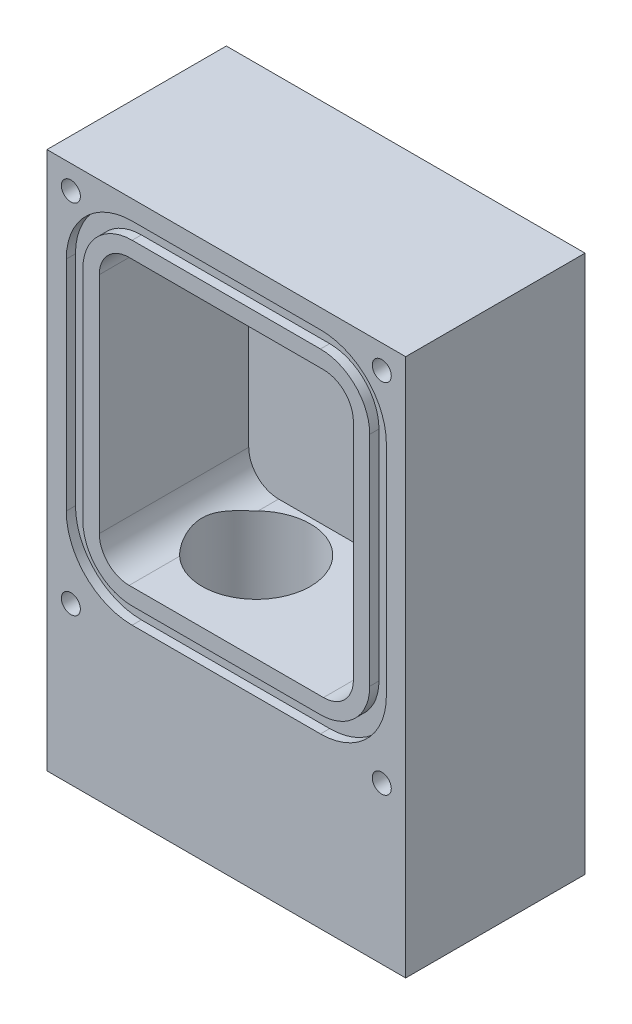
ISO-10303-21;
HEADER;
FILE_DESCRIPTION(('STEP AP214'),'2;1');
FILE_NAME('part.step','',(''),(''),'','','');
FILE_SCHEMA(('AUTOMOTIVE_DESIGN { 1 0 10303 214 1 1 1 1 }'));
ENDSEC;
DATA;
#1=APPLICATION_CONTEXT('core data for automotive mechanical design processes');
#2=APPLICATION_PROTOCOL_DEFINITION('international standard','automotive_design',2000,#1);
#3=PRODUCT_CONTEXT('',#1,'mechanical');
#4=PRODUCT('Part','Part','',(#3));
#5=PRODUCT_RELATED_PRODUCT_CATEGORY('part','',(#4));
#6=PRODUCT_DEFINITION_FORMATION('','',#4);
#7=PRODUCT_DEFINITION_CONTEXT('part definition',#1,'design');
#8=PRODUCT_DEFINITION('design','',#6,#7);
#9=PRODUCT_DEFINITION_SHAPE('','',#8);
#10=(LENGTH_UNIT() NAMED_UNIT(*) SI_UNIT(.MILLI.,.METRE.));
#11=(NAMED_UNIT(*) PLANE_ANGLE_UNIT() SI_UNIT($,.RADIAN.));
#12=(NAMED_UNIT(*) SI_UNIT($,.STERADIAN.) SOLID_ANGLE_UNIT());
#13=UNCERTAINTY_MEASURE_WITH_UNIT(LENGTH_MEASURE(1.E-05),#10,'distance_accuracy_value','');
#14=(GEOMETRIC_REPRESENTATION_CONTEXT(3) GLOBAL_UNCERTAINTY_ASSIGNED_CONTEXT((#13)) GLOBAL_UNIT_ASSIGNED_CONTEXT((#10,
#11,#12)) REPRESENTATION_CONTEXT('',''));
#15=CARTESIAN_POINT('',(0.,0.,0.));
#16=DIRECTION('',(0.,0.,1.));
#17=DIRECTION('',(1.,0.,0.));
#18=AXIS2_PLACEMENT_3D('',#15,#16,#17);
#19=CARTESIAN_POINT('',(0.,0.,38.1));
#20=DIRECTION('',(0.,0.,-1.));
#21=DIRECTION('',(-1.,0.,0.));
#22=AXIS2_PLACEMENT_3D('',#19,#20,#21);
#23=PLANE('',#22);
#24=DIRECTION('',(1.,0.,0.));
#25=VECTOR('',#24,1.);
#26=CARTESIAN_POINT('',(17.4625,42.8625,38.1));
#27=LINE('',#26,#25);
#28=CARTESIAN_POINT('',(17.4625,42.8625,38.1));
#29=VERTEX_POINT('',#28);
#30=CARTESIAN_POINT('',(58.7375,42.8625,38.1));
#31=VERTEX_POINT('',#30);
#32=EDGE_CURVE('E455',#29,#31,#27,.T.);
#33=ORIENTED_EDGE('',*,*,#32,.F.);
#34=CARTESIAN_POINT('',(17.4625,49.2125,38.1));
#35=DIRECTION('',(0.,0.,1.));
#36=DIRECTION('',(1.,0.,0.));
#37=AXIS2_PLACEMENT_3D('',#34,#35,#36);
#38=CIRCLE('',#37,6.35);
#39=CARTESIAN_POINT('',(11.1125,49.2125,38.1));
#40=VERTEX_POINT('',#39);
#41=EDGE_CURVE('E426',#40,#29,#38,.T.);
#42=ORIENTED_EDGE('',*,*,#41,.F.);
#43=DIRECTION('',(0.,-1.,0.));
#44=VECTOR('',#43,1.);
#45=CARTESIAN_POINT('',(11.1125,49.2125,38.1));
#46=LINE('',#45,#44);
#47=CARTESIAN_POINT('',(11.1125,96.8375,38.1));
#48=VERTEX_POINT('',#47);
#49=EDGE_CURVE('E431',#48,#40,#46,.T.);
#50=ORIENTED_EDGE('',*,*,#49,.F.);
#51=CARTESIAN_POINT('',(17.4625,96.8375,38.1));
#52=DIRECTION('',(0.,0.,1.));
#53=DIRECTION('',(1.,0.,0.));
#54=AXIS2_PLACEMENT_3D('',#51,#52,#53);
#55=CIRCLE('',#54,6.35);
#56=CARTESIAN_POINT('',(17.4625,103.1875,38.1));
#57=VERTEX_POINT('',#56);
#58=EDGE_CURVE('E470',#57,#48,#55,.T.);
#59=ORIENTED_EDGE('',*,*,#58,.F.);
#60=DIRECTION('',(-1.,0.,0.));
#61=VECTOR('',#60,1.);
#62=CARTESIAN_POINT('',(17.4625,103.1875,38.1));
#63=LINE('',#62,#61);
#64=CARTESIAN_POINT('',(58.7375,103.1875,38.1));
#65=VERTEX_POINT('',#64);
#66=EDGE_CURVE('E467',#65,#57,#63,.T.);
#67=ORIENTED_EDGE('',*,*,#66,.F.);
#68=CARTESIAN_POINT('',(58.7375,96.8375,38.1));
#69=DIRECTION('',(0.,0.,1.));
#70=DIRECTION('',(1.,0.,0.));
#71=AXIS2_PLACEMENT_3D('',#68,#69,#70);
#72=CIRCLE('',#71,6.34999999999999);
#73=CARTESIAN_POINT('',(65.0875,96.8375,38.1));
#74=VERTEX_POINT('',#73);
#75=EDGE_CURVE('E464',#74,#65,#72,.T.);
#76=ORIENTED_EDGE('',*,*,#75,.F.);
#77=DIRECTION('',(0.,1.,0.));
#78=VECTOR('',#77,1.);
#79=CARTESIAN_POINT('',(65.0875,49.2125,38.1));
#80=LINE('',#79,#78);
#81=CARTESIAN_POINT('',(65.0875,49.2125,38.1));
#82=VERTEX_POINT('',#81);
#83=EDGE_CURVE('E461',#82,#74,#80,.T.);
#84=ORIENTED_EDGE('',*,*,#83,.F.);
#85=CARTESIAN_POINT('',(58.7375,49.2125,38.1));
#86=DIRECTION('',(0.,0.,1.));
#87=DIRECTION('',(-1.,0.,0.));
#88=AXIS2_PLACEMENT_3D('',#85,#86,#87);
#89=CIRCLE('',#88,6.35);
#90=EDGE_CURVE('E458',#31,#82,#89,.T.);
#91=ORIENTED_EDGE('',*,*,#90,.F.);
#92=EDGE_LOOP('',(#33,#42,#50,#59,#67,#76,#84,#91));
#93=FACE_BOUND('',#92,.T.);
#94=CARTESIAN_POINT('',(58.1025023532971,49.8475,38.1));
#95=DIRECTION('',(0.,0.,1.));
#96=DIRECTION('',(1.,0.,0.));
#97=AXIS2_PLACEMENT_3D('',#94,#95,#96);
#98=CIRCLE('',#97,10.4648);
#99=CARTESIAN_POINT('',(58.1025023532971,39.3827,38.1));
#100=VERTEX_POINT('',#99);
#101=CARTESIAN_POINT('',(68.5673023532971,49.8475,38.1));
#102=VERTEX_POINT('',#101);
#103=EDGE_CURVE('E281',#100,#102,#98,.T.);
#104=ORIENTED_EDGE('',*,*,#103,.T.);
#105=DIRECTION('',(0.,1.,0.));
#106=VECTOR('',#105,1.);
#107=CARTESIAN_POINT('',(68.5673023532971,49.8475,38.1));
#108=LINE('',#107,#106);
#109=CARTESIAN_POINT('',(68.5673023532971,96.2025,38.1));
#110=VERTEX_POINT('',#109);
#111=EDGE_CURVE('E310',#102,#110,#108,.T.);
#112=ORIENTED_EDGE('',*,*,#111,.T.);
#113=CARTESIAN_POINT('',(58.1025023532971,96.2025,38.1));
#114=DIRECTION('',(0.,0.,1.));
#115=DIRECTION('',(1.,0.,0.));
#116=AXIS2_PLACEMENT_3D('',#113,#114,#115);
#117=CIRCLE('',#116,10.4648);
#118=CARTESIAN_POINT('',(58.1025023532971,106.6673,38.1));
#119=VERTEX_POINT('',#118);
#120=EDGE_CURVE('E63',#110,#119,#117,.T.);
#121=ORIENTED_EDGE('',*,*,#120,.T.);
#122=DIRECTION('',(-1.,0.,0.));
#123=VECTOR('',#122,1.);
#124=CARTESIAN_POINT('',(58.1025023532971,106.6673,38.1));
#125=LINE('',#124,#123);
#126=CARTESIAN_POINT('',(18.0974976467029,106.6673,38.1));
#127=VERTEX_POINT('',#126);
#128=EDGE_CURVE('E314',#119,#127,#125,.T.);
#129=ORIENTED_EDGE('',*,*,#128,.T.);
#130=CARTESIAN_POINT('',(18.0974976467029,96.2025,38.1));
#131=DIRECTION('',(0.,0.,1.));
#132=DIRECTION('',(1.,0.,0.));
#133=AXIS2_PLACEMENT_3D('',#130,#131,#132);
#134=CIRCLE('',#133,10.4648);
#135=CARTESIAN_POINT('',(7.63269764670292,96.2025,38.1));
#136=VERTEX_POINT('',#135);
#137=EDGE_CURVE('E317',#127,#136,#134,.T.);
#138=ORIENTED_EDGE('',*,*,#137,.T.);
#139=DIRECTION('',(0.,-1.,0.));
#140=VECTOR('',#139,1.);
#141=CARTESIAN_POINT('',(7.63269764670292,96.2025,38.1));
#142=LINE('',#141,#140);
#143=CARTESIAN_POINT('',(7.63269764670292,49.8475,38.1));
#144=VERTEX_POINT('',#143);
#145=EDGE_CURVE('E320',#136,#144,#142,.T.);
#146=ORIENTED_EDGE('',*,*,#145,.T.);
#147=CARTESIAN_POINT('',(18.0974976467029,49.8475,38.1));
#148=DIRECTION('',(0.,0.,1.));
#149=DIRECTION('',(-1.,0.,0.));
#150=AXIS2_PLACEMENT_3D('',#147,#148,#149);
#151=CIRCLE('',#150,10.4648);
#152=CARTESIAN_POINT('',(18.0974976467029,39.3827,38.1));
#153=VERTEX_POINT('',#152);
#154=EDGE_CURVE('E323',#144,#153,#151,.T.);
#155=ORIENTED_EDGE('',*,*,#154,.T.);
#156=DIRECTION('',(1.,0.,0.));
#157=VECTOR('',#156,1.);
#158=CARTESIAN_POINT('',(18.0974976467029,39.3827,38.1));
#159=LINE('',#158,#157);
#160=EDGE_CURVE('E286',#153,#100,#159,.T.);
#161=ORIENTED_EDGE('',*,*,#160,.T.);
#162=EDGE_LOOP('',(#104,#112,#121,#129,#138,#146,#155,#161));
#163=FACE_BOUND('',#162,.T.);
#164=ADVANCED_FACE('F36',(#93,#163),#23,.F.);
#165=CARTESIAN_POINT('',(0.,0.,38.1));
#166=DIRECTION('',(1.,0.,0.));
#167=DIRECTION('',(0.,0.,-1.));
#168=AXIS2_PLACEMENT_3D('',#165,#166,#167);
#169=PLANE('',#168);
#170=DIRECTION('',(0.,-1.,0.));
#171=VECTOR('',#170,1.);
#172=CARTESIAN_POINT('',(0.,0.,0.));
#173=LINE('',#172,#171);
#174=CARTESIAN_POINT('',(0.,114.3,0.));
#175=VERTEX_POINT('',#174);
#176=CARTESIAN_POINT('',(0.,0.,0.));
#177=VERTEX_POINT('',#176);
#178=EDGE_CURVE('E477',#175,#177,#173,.T.);
#179=ORIENTED_EDGE('',*,*,#178,.T.);
#180=DIRECTION('',(0.,0.,-1.));
#181=VECTOR('',#180,1.);
#182=CARTESIAN_POINT('',(0.,0.,38.1));
#183=LINE('',#182,#181);
#184=CARTESIAN_POINT('',(0.,0.,38.1));
#185=VERTEX_POINT('',#184);
#186=EDGE_CURVE('E521',#185,#177,#183,.T.);
#187=ORIENTED_EDGE('',*,*,#186,.F.);
#188=DIRECTION('',(0.,-1.,0.));
#189=VECTOR('',#188,1.);
#190=CARTESIAN_POINT('',(0.,0.,38.1));
#191=LINE('',#190,#189);
#192=CARTESIAN_POINT('',(0.,114.3,38.1));
#193=VERTEX_POINT('',#192);
#194=EDGE_CURVE('E495',#193,#185,#191,.T.);
#195=ORIENTED_EDGE('',*,*,#194,.F.);
#196=DIRECTION('',(0.,0.,-1.));
#197=VECTOR('',#196,1.);
#198=CARTESIAN_POINT('',(0.,114.3,38.1));
#199=LINE('',#198,#197);
#200=EDGE_CURVE('E505',#193,#175,#199,.T.);
#201=ORIENTED_EDGE('',*,*,#200,.T.);
#202=EDGE_LOOP('',(#179,#187,#195,#201));
#203=FACE_BOUND('',#202,.T.);
#204=ADVANCED_FACE('F534',(#203),#169,.F.);
#205=CARTESIAN_POINT('',(0.,0.,38.1));
#206=DIRECTION('',(0.,1.,0.));
#207=DIRECTION('',(0.,0.,1.));
#208=AXIS2_PLACEMENT_3D('',#205,#206,#207);
#209=PLANE('',#208);
#210=CARTESIAN_POINT('',(59.69,0.,19.05));
#211=DIRECTION('',(0.,-1.,0.));
#212=DIRECTION('',(0.,0.,-1.));
#213=AXIS2_PLACEMENT_3D('',#210,#211,#212);
#214=CIRCLE('',#213,4.96062);
#215=CARTESIAN_POINT('',(59.69,0.,14.08938));
#216=VERTEX_POINT('',#215);
#217=EDGE_CURVE('E392',#216,#216,#214,.T.);
#218=ORIENTED_EDGE('',*,*,#217,.F.);
#219=EDGE_LOOP('',(#218));
#220=FACE_BOUND('',#219,.T.);
#221=CARTESIAN_POINT('',(25.4,0.,19.05));
#222=DIRECTION('',(0.,-1.,0.));
#223=DIRECTION('',(0.,0.,-1.));
#224=AXIS2_PLACEMENT_3D('',#221,#222,#223);
#225=CIRCLE('',#224,13.9674854);
#226=CARTESIAN_POINT('',(25.4,0.,5.0825146));
#227=VERTEX_POINT('',#226);
#228=EDGE_CURVE('E411',#227,#227,#225,.T.);
#229=ORIENTED_EDGE('',*,*,#228,.F.);
#230=EDGE_LOOP('',(#229));
#231=FACE_BOUND('',#230,.T.);
#232=DIRECTION('',(1.,0.,0.));
#233=VECTOR('',#232,1.);
#234=CARTESIAN_POINT('',(0.,0.,0.));
#235=LINE('',#234,#233);
#236=CARTESIAN_POINT('',(76.2,0.,0.));
#237=VERTEX_POINT('',#236);
#238=EDGE_CURVE('E508',#177,#237,#235,.T.);
#239=ORIENTED_EDGE('',*,*,#238,.T.);
#240=DIRECTION('',(0.,0.,-1.));
#241=VECTOR('',#240,1.);
#242=CARTESIAN_POINT('',(76.2,0.,38.1));
#243=LINE('',#242,#241);
#244=CARTESIAN_POINT('',(76.2,0.,38.1));
#245=VERTEX_POINT('',#244);
#246=EDGE_CURVE('E518',#245,#237,#243,.T.);
#247=ORIENTED_EDGE('',*,*,#246,.F.);
#248=DIRECTION('',(1.,0.,0.));
#249=VECTOR('',#248,1.);
#250=CARTESIAN_POINT('',(0.,0.,38.1));
#251=LINE('',#250,#249);
#252=EDGE_CURVE('E498',#185,#245,#251,.T.);
#253=ORIENTED_EDGE('',*,*,#252,.F.);
#254=ORIENTED_EDGE('',*,*,#186,.T.);
#255=EDGE_LOOP('',(#239,#247,#253,#254));
#256=FACE_BOUND('',#255,.T.);
#257=ADVANCED_FACE('F537',(#220,#231,#256),#209,.F.);
#258=CARTESIAN_POINT('',(76.2,0.,38.1));
#259=DIRECTION('',(-1.,0.,0.));
#260=DIRECTION('',(0.,0.,1.));
#261=AXIS2_PLACEMENT_3D('',#258,#259,#260);
#262=PLANE('',#261);
#263=DIRECTION('',(0.,1.,0.));
#264=VECTOR('',#263,1.);
#265=CARTESIAN_POINT('',(76.2,0.,0.));
#266=LINE('',#265,#264);
#267=CARTESIAN_POINT('',(76.2,114.3,0.));
#268=VERTEX_POINT('',#267);
#269=EDGE_CURVE('E510',#237,#268,#266,.T.);
#270=ORIENTED_EDGE('',*,*,#269,.T.);
#271=DIRECTION('',(0.,0.,-1.));
#272=VECTOR('',#271,1.);
#273=CARTESIAN_POINT('',(76.2,114.3,38.1));
#274=LINE('',#273,#272);
#275=CARTESIAN_POINT('',(76.2,114.3,38.1));
#276=VERTEX_POINT('',#275);
#277=EDGE_CURVE('E515',#276,#268,#274,.T.);
#278=ORIENTED_EDGE('',*,*,#277,.F.);
#279=DIRECTION('',(0.,1.,0.));
#280=VECTOR('',#279,1.);
#281=CARTESIAN_POINT('',(76.2,0.,38.1));
#282=LINE('',#281,#280);
#283=EDGE_CURVE('E501',#245,#276,#282,.T.);
#284=ORIENTED_EDGE('',*,*,#283,.F.);
#285=ORIENTED_EDGE('',*,*,#246,.T.);
#286=EDGE_LOOP('',(#270,#278,#284,#285));
#287=FACE_BOUND('',#286,.T.);
#288=ADVANCED_FACE('F541',(#287),#262,.F.);
#289=CARTESIAN_POINT('',(0.,114.3,38.1));
#290=DIRECTION('',(0.,-1.,0.));
#291=DIRECTION('',(0.,0.,-1.));
#292=AXIS2_PLACEMENT_3D('',#289,#290,#291);
#293=PLANE('',#292);
#294=DIRECTION('',(-1.,0.,0.));
#295=VECTOR('',#294,1.);
#296=CARTESIAN_POINT('',(0.,114.3,0.));
#297=LINE('',#296,#295);
#298=EDGE_CURVE('E499',#268,#175,#297,.T.);
#299=ORIENTED_EDGE('',*,*,#298,.T.);
#300=ORIENTED_EDGE('',*,*,#200,.F.);
#301=DIRECTION('',(-1.,0.,0.));
#302=VECTOR('',#301,1.);
#303=CARTESIAN_POINT('',(0.,114.3,38.1));
#304=LINE('',#303,#302);
#305=EDGE_CURVE('E503',#276,#193,#304,.T.);
#306=ORIENTED_EDGE('',*,*,#305,.F.);
#307=ORIENTED_EDGE('',*,*,#277,.T.);
#308=EDGE_LOOP('',(#299,#300,#306,#307));
#309=FACE_BOUND('',#308,.T.);
#310=ADVANCED_FACE('F545',(#309),#293,.F.);
#311=CARTESIAN_POINT('',(5.08,33.3121,38.1));
#312=DIRECTION('',(0.,0.,1.));
#313=DIRECTION('',(1.,0.,0.));
#314=AXIS2_PLACEMENT_3D('',#311,#312,#313);
#315=CIRCLE('',#314,2.0193);
#316=CARTESIAN_POINT('',(7.0993,33.3121,38.1));
#317=VERTEX_POINT('',#316);
#318=EDGE_CURVE('E259',#317,#317,#315,.T.);
#319=ORIENTED_EDGE('',*,*,#318,.F.);
#320=EDGE_LOOP('',(#319));
#321=FACE_BOUND('',#320,.T.);
#322=CARTESIAN_POINT('',(71.12,33.3121,38.1));
#323=DIRECTION('',(0.,0.,1.));
#324=DIRECTION('',(1.,0.,0.));
#325=AXIS2_PLACEMENT_3D('',#322,#323,#324);
#326=CIRCLE('',#325,2.0193);
#327=CARTESIAN_POINT('',(73.1393,33.3121,38.1));
#328=VERTEX_POINT('',#327);
#329=EDGE_CURVE('E258',#328,#328,#326,.T.);
#330=ORIENTED_EDGE('',*,*,#329,.F.);
#331=EDGE_LOOP('',(#330));
#332=FACE_BOUND('',#331,.T.);
#333=CARTESIAN_POINT('',(71.12,109.22,38.1));
#334=DIRECTION('',(0.,0.,1.));
#335=DIRECTION('',(1.,0.,0.));
#336=AXIS2_PLACEMENT_3D('',#333,#334,#335);
#337=CIRCLE('',#336,2.0193);
#338=CARTESIAN_POINT('',(73.1393,109.22,38.1));
#339=VERTEX_POINT('',#338);
#340=EDGE_CURVE('E269',#339,#339,#337,.T.);
#341=ORIENTED_EDGE('',*,*,#340,.F.);
#342=EDGE_LOOP('',(#341));
#343=FACE_BOUND('',#342,.T.);
#344=CARTESIAN_POINT('',(5.08,109.22,38.1));
#345=DIRECTION('',(0.,0.,1.));
#346=DIRECTION('',(1.,0.,0.));
#347=AXIS2_PLACEMENT_3D('',#344,#345,#346);
#348=CIRCLE('',#347,2.0193);
#349=CARTESIAN_POINT('',(7.0993,109.22,38.1));
#350=VERTEX_POINT('',#349);
#351=EDGE_CURVE('E275',#350,#350,#348,.T.);
#352=ORIENTED_EDGE('',*,*,#351,.F.);
#353=EDGE_LOOP('',(#352));
#354=FACE_BOUND('',#353,.T.);
#355=DIRECTION('',(0.,-1.,0.));
#356=VECTOR('',#355,1.);
#357=CARTESIAN_POINT('',(4.10209764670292,96.2025,38.1));
#358=LINE('',#357,#356);
#359=CARTESIAN_POINT('',(4.10209764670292,96.2025,38.1));
#360=VERTEX_POINT('',#359);
#361=CARTESIAN_POINT('',(4.10209764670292,49.8475,38.1));
#362=VERTEX_POINT('',#361);
#363=EDGE_CURVE('E370',#360,#362,#358,.T.);
#364=ORIENTED_EDGE('',*,*,#363,.F.);
#365=CARTESIAN_POINT('',(18.0974976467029,96.2025,38.1));
#366=DIRECTION('',(0.,0.,1.));
#367=DIRECTION('',(1.,0.,0.));
#368=AXIS2_PLACEMENT_3D('',#365,#366,#367);
#369=CIRCLE('',#368,13.9954);
#370=CARTESIAN_POINT('',(18.0974976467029,110.1979,38.1));
#371=VERTEX_POINT('',#370);
#372=EDGE_CURVE('E55',#371,#360,#369,.T.);
#373=ORIENTED_EDGE('',*,*,#372,.F.);
#374=DIRECTION('',(-1.,0.,0.));
#375=VECTOR('',#374,1.);
#376=CARTESIAN_POINT('',(58.1025023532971,110.1979,38.1));
#377=LINE('',#376,#375);
#378=CARTESIAN_POINT('',(58.1025023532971,110.1979,38.1));
#379=VERTEX_POINT('',#378);
#380=EDGE_CURVE('E347',#379,#371,#377,.T.);
#381=ORIENTED_EDGE('',*,*,#380,.F.);
#382=CARTESIAN_POINT('',(58.1025023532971,96.2025,38.1));
#383=DIRECTION('',(0.,0.,1.));
#384=DIRECTION('',(1.,0.,0.));
#385=AXIS2_PLACEMENT_3D('',#382,#383,#384);
#386=CIRCLE('',#385,13.9954);
#387=CARTESIAN_POINT('',(72.0979023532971,96.2025,38.1));
#388=VERTEX_POINT('',#387);
#389=EDGE_CURVE('E385',#388,#379,#386,.T.);
#390=ORIENTED_EDGE('',*,*,#389,.F.);
#391=DIRECTION('',(0.,1.,0.));
#392=VECTOR('',#391,1.);
#393=CARTESIAN_POINT('',(72.0979023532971,49.8475,38.1));
#394=LINE('',#393,#392);
#395=CARTESIAN_POINT('',(72.0979023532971,49.8475,38.1));
#396=VERTEX_POINT('',#395);
#397=EDGE_CURVE('E382',#396,#388,#394,.T.);
#398=ORIENTED_EDGE('',*,*,#397,.F.);
#399=CARTESIAN_POINT('',(58.1025023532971,49.8475,38.1));
#400=DIRECTION('',(0.,0.,1.));
#401=DIRECTION('',(1.,0.,0.));
#402=AXIS2_PLACEMENT_3D('',#399,#400,#401);
#403=CIRCLE('',#402,13.9954);
#404=CARTESIAN_POINT('',(58.1025023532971,35.8521,38.1));
#405=VERTEX_POINT('',#404);
#406=EDGE_CURVE('E379',#405,#396,#403,.T.);
#407=ORIENTED_EDGE('',*,*,#406,.F.);
#408=DIRECTION('',(1.,0.,0.));
#409=VECTOR('',#408,1.);
#410=CARTESIAN_POINT('',(18.0974976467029,35.8521,38.1));
#411=LINE('',#410,#409);
#412=CARTESIAN_POINT('',(18.0974976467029,35.8521,38.1));
#413=VERTEX_POINT('',#412);
#414=EDGE_CURVE('E376',#413,#405,#411,.T.);
#415=ORIENTED_EDGE('',*,*,#414,.F.);
#416=CARTESIAN_POINT('',(18.0974976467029,49.8475,38.1));
#417=DIRECTION('',(0.,0.,1.));
#418=DIRECTION('',(-1.,0.,0.));
#419=AXIS2_PLACEMENT_3D('',#416,#417,#418);
#420=CIRCLE('',#419,13.9954);
#421=EDGE_CURVE('E373',#362,#413,#420,.T.);
#422=ORIENTED_EDGE('',*,*,#421,.F.);
#423=EDGE_LOOP('',(#364,#373,#381,#390,#398,#407,#415,#422));
#424=FACE_BOUND('',#423,.T.);
#425=ORIENTED_EDGE('',*,*,#194,.T.);
#426=ORIENTED_EDGE('',*,*,#252,.T.);
#427=ORIENTED_EDGE('',*,*,#283,.T.);
#428=ORIENTED_EDGE('',*,*,#305,.T.);
#429=EDGE_LOOP('',(#425,#426,#427,#428));
#430=FACE_BOUND('',#429,.T.);
#431=ADVANCED_FACE('F549',(#321,#332,#343,#354,#424,#430),#23,.F.);
#432=CARTESIAN_POINT('',(0.,0.,0.));
#433=DIRECTION('',(0.,0.,-1.));
#434=DIRECTION('',(-1.,0.,0.));
#435=AXIS2_PLACEMENT_3D('',#432,#433,#434);
#436=PLANE('',#435);
#437=ORIENTED_EDGE('',*,*,#178,.F.);
#438=ORIENTED_EDGE('',*,*,#298,.F.);
#439=ORIENTED_EDGE('',*,*,#269,.F.);
#440=ORIENTED_EDGE('',*,*,#238,.F.);
#441=EDGE_LOOP('',(#437,#438,#439,#440));
#442=FACE_BOUND('',#441,.T.);
#443=ADVANCED_FACE('F551',(#442),#436,.T.);
#444=CARTESIAN_POINT('',(17.4625,49.2125,6.35));
#445=DIRECTION('',(0.,0.,1.));
#446=DIRECTION('',(1.,0.,0.));
#447=AXIS2_PLACEMENT_3D('',#444,#445,#446);
#448=CYLINDRICAL_SURFACE('',#447,6.35);
#449=DIRECTION('',(0.,0.,1.));
#450=VECTOR('',#449,1.);
#451=CARTESIAN_POINT('',(17.4625,42.8625,6.35));
#452=LINE('',#451,#450);
#453=CARTESIAN_POINT('',(17.4625,42.8625,27.3799899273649));
#454=VERTEX_POINT('',#453);
#455=EDGE_CURVE('E452',#454,#29,#452,.T.);
#456=ORIENTED_EDGE('',*,*,#455,.F.);
#457=CARTESIAN_POINT('',(17.4625,42.8625,27.3799899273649));
#458=CARTESIAN_POINT('',(17.2665479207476,42.8625263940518,27.1933247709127));
#459=CARTESIAN_POINT('',(17.077399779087,42.8715643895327,26.9998495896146));
#460=CARTESIAN_POINT('',(16.7139824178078,42.9041308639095,26.6010366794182));
#461=CARTESIAN_POINT('',(16.5396910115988,42.927637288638,26.3957174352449));
#462=CARTESIAN_POINT('',(16.2072903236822,42.9855189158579,25.9751995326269));
#463=CARTESIAN_POINT('',(16.0491219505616,43.0198523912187,25.7600414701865));
#464=CARTESIAN_POINT('',(15.7486262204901,43.0961957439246,25.3201349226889));
#465=CARTESIAN_POINT('',(15.6063054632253,43.1382088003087,25.0953824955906));
#466=CARTESIAN_POINT('',(15.3334954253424,43.2282585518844,24.6297249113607));
#467=CARTESIAN_POINT('',(15.2035494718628,43.2764479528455,24.3885316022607));
#468=CARTESIAN_POINT('',(14.9612977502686,43.3743877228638,23.8977839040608));
#469=CARTESIAN_POINT('',(14.8489905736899,43.4241379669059,23.648230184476));
#470=CARTESIAN_POINT('',(14.6422027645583,43.5220230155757,23.1411491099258));
#471=CARTESIAN_POINT('',(14.5477446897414,43.5701557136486,22.8836121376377));
#472=CARTESIAN_POINT('',(14.377258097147,43.6615412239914,22.3616695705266));
#473=CARTESIAN_POINT('',(14.3012278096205,43.7047945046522,22.0972646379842));
#474=CARTESIAN_POINT('',(14.1680883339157,43.7833802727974,21.5625116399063));
#475=CARTESIAN_POINT('',(14.1109814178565,43.8187118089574,21.2921628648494));
#476=CARTESIAN_POINT('',(14.0162507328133,43.8787371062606,20.746891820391));
#477=CARTESIAN_POINT('',(13.978625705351,43.903431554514,20.4719698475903));
#478=CARTESIAN_POINT('',(13.9233722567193,43.9401015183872,19.9197667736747));
#479=CARTESIAN_POINT('',(13.9057073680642,43.952100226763,19.6424909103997));
#480=CARTESIAN_POINT('',(13.8905075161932,43.9624086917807,19.0871312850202));
#481=CARTESIAN_POINT('',(13.8929721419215,43.960718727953,18.809047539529));
#482=CARTESIAN_POINT('',(13.9179837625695,43.9438071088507,18.254417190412));
#483=CARTESIAN_POINT('',(13.940515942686,43.9285954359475,17.9778696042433));
#484=CARTESIAN_POINT('',(14.005325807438,43.8859686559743,17.4280620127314));
#485=CARTESIAN_POINT('',(14.0476046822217,43.8585528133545,17.1548022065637));
#486=CARTESIAN_POINT('',(14.1515451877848,43.7936601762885,16.61251644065));
#487=CARTESIAN_POINT('',(14.2132554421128,43.7561581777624,16.3435028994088));
#488=CARTESIAN_POINT('',(14.3554849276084,43.6739355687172,15.8116128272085));
#489=CARTESIAN_POINT('',(14.4360073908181,43.6292137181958,15.5487373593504));
#490=CARTESIAN_POINT('',(14.6202274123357,43.5331212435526,15.0160489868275));
#491=CARTESIAN_POINT('',(14.7249415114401,43.4815220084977,14.7466278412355));
#492=CARTESIAN_POINT('',(14.9542137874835,43.3775317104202,14.2166072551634));
#493=CARTESIAN_POINT('',(15.0787745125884,43.3251405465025,13.9560089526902));
#494=CARTESIAN_POINT('',(15.4810406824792,43.1727666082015,13.1901175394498));
#495=CARTESIAN_POINT('',(15.7880489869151,43.0771537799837,12.6986513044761));
#496=CARTESIAN_POINT('',(16.3298992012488,42.9610471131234,11.962152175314));
#497=CARTESIAN_POINT('',(16.5400794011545,42.9258938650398,11.7010465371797));
#498=CARTESIAN_POINT('',(16.8729381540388,42.8889396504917,11.3227657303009));
#499=CARTESIAN_POINT('',(16.9869823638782,42.8792485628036,11.1987491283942));
#500=CARTESIAN_POINT('',(17.2206462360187,42.8660283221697,10.9556005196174));
#501=CARTESIAN_POINT('',(17.340269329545,42.8625030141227,10.8364716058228));
#502=CARTESIAN_POINT('',(17.4625,42.8625,10.7200100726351));
#503=B_SPLINE_CURVE_WITH_KNOTS('',3,(#457,#458,#459,#460,#461,#462,#463,#464,#465,#466,#467,
#468,#469,#470,#471,#472,#473,#474,#475,#476,#477,#478,#479,#480,#481,#482,#483,#484,#485,#486,
#487,#488,#489,#490,#491,#492,#493,#494,#495,#496,#497,#498,#499,#500,#501,#502),.UNSPECIFIED.,
.F.,.F.,(4,2,2,2,2,2,2,2,2,2,2,2,2,2,2,2,2,2,2,2,2,2,4),(0.,0.811247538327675,1.62126154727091,
2.42819117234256,3.23545559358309,4.06927985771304,4.90303750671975,5.73784191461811,
6.57256611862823,7.40739051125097,8.24216096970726,9.07540381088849,9.90862963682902,
10.741240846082,11.5739022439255,12.4086640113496,13.2435693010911,14.1235530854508,
15.0036499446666,16.7571863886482,17.7665944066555,18.2726168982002,18.7789548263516),.UNSPECIFIED.);
#504=CARTESIAN_POINT('',(17.4625,42.8625,10.7200100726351));
#505=VERTEX_POINT('',#504);
#506=EDGE_CURVE('E48',#454,#505,#503,.T.);
#507=ORIENTED_EDGE('',*,*,#506,.T.);
#508=CARTESIAN_POINT('',(17.4625,42.8625,6.35));
#509=VERTEX_POINT('',#508);
#510=EDGE_CURVE('E492',#509,#505,#452,.T.);
#511=ORIENTED_EDGE('',*,*,#510,.F.);
#512=CARTESIAN_POINT('',(17.4625,49.2125,6.35));
#513=DIRECTION('',(0.,0.,1.));
#514=DIRECTION('',(1.,0.,0.));
#515=AXIS2_PLACEMENT_3D('',#512,#513,#514);
#516=CIRCLE('',#515,6.35);
#517=CARTESIAN_POINT('',(11.1125,49.2125,6.35));
#518=VERTEX_POINT('',#517);
#519=EDGE_CURVE('E427',#518,#509,#516,.T.);
#520=ORIENTED_EDGE('',*,*,#519,.F.);
#521=DIRECTION('',(0.,0.,1.));
#522=VECTOR('',#521,1.);
#523=CARTESIAN_POINT('',(11.1125,49.2125,6.35));
#524=LINE('',#523,#522);
#525=EDGE_CURVE('E475',#518,#40,#524,.T.);
#526=ORIENTED_EDGE('',*,*,#525,.T.);
#527=ORIENTED_EDGE('',*,*,#41,.T.);
#528=EDGE_LOOP('',(#456,#507,#511,#520,#526,#527));
#529=FACE_BOUND('',#528,.T.);
#530=ADVANCED_FACE('F528',(#529),#448,.F.);
#531=CARTESIAN_POINT('',(11.1125,49.2125,6.35));
#532=DIRECTION('',(-1.,0.,0.));
#533=DIRECTION('',(0.,-1.,0.));
#534=AXIS2_PLACEMENT_3D('',#531,#532,#533);
#535=PLANE('',#534);
#536=ORIENTED_EDGE('',*,*,#49,.T.);
#537=ORIENTED_EDGE('',*,*,#525,.F.);
#538=DIRECTION('',(0.,-1.,0.));
#539=VECTOR('',#538,1.);
#540=CARTESIAN_POINT('',(11.1125,49.2125,6.35));
#541=LINE('',#540,#539);
#542=CARTESIAN_POINT('',(11.1125,96.8375,6.35));
#543=VERTEX_POINT('',#542);
#544=EDGE_CURVE('E449',#543,#518,#541,.T.);
#545=ORIENTED_EDGE('',*,*,#544,.F.);
#546=DIRECTION('',(0.,0.,1.));
#547=VECTOR('',#546,1.);
#548=CARTESIAN_POINT('',(11.1125,96.8375,6.35));
#549=LINE('',#548,#547);
#550=EDGE_CURVE('E478',#543,#48,#549,.T.);
#551=ORIENTED_EDGE('',*,*,#550,.T.);
#552=EDGE_LOOP('',(#536,#537,#545,#551));
#553=FACE_BOUND('',#552,.T.);
#554=ADVANCED_FACE('F680',(#553),#535,.F.);
#555=CARTESIAN_POINT('',(17.4625,96.8375,6.35));
#556=DIRECTION('',(0.,0.,1.));
#557=DIRECTION('',(1.,0.,0.));
#558=AXIS2_PLACEMENT_3D('',#555,#556,#557);
#559=CYLINDRICAL_SURFACE('',#558,6.35);
#560=ORIENTED_EDGE('',*,*,#58,.T.);
#561=ORIENTED_EDGE('',*,*,#550,.F.);
#562=CARTESIAN_POINT('',(17.4625,96.8375,6.35));
#563=DIRECTION('',(0.,0.,1.));
#564=DIRECTION('',(1.,0.,0.));
#565=AXIS2_PLACEMENT_3D('',#562,#563,#564);
#566=CIRCLE('',#565,6.35);
#567=CARTESIAN_POINT('',(17.4625,103.1875,6.35));
#568=VERTEX_POINT('',#567);
#569=EDGE_CURVE('E446',#568,#543,#566,.T.);
#570=ORIENTED_EDGE('',*,*,#569,.F.);
#571=DIRECTION('',(0.,0.,1.));
#572=VECTOR('',#571,1.);
#573=CARTESIAN_POINT('',(17.4625,103.1875,6.35));
#574=LINE('',#573,#572);
#575=EDGE_CURVE('E480',#568,#57,#574,.T.);
#576=ORIENTED_EDGE('',*,*,#575,.T.);
#577=EDGE_LOOP('',(#560,#561,#570,#576));
#578=FACE_BOUND('',#577,.T.);
#579=ADVANCED_FACE('F683',(#578),#559,.F.);
#580=CARTESIAN_POINT('',(17.4625,103.1875,6.35));
#581=DIRECTION('',(0.,1.,0.));
#582=DIRECTION('',(0.,0.,1.));
#583=AXIS2_PLACEMENT_3D('',#580,#581,#582);
#584=PLANE('',#583);
#585=ORIENTED_EDGE('',*,*,#66,.T.);
#586=ORIENTED_EDGE('',*,*,#575,.F.);
#587=DIRECTION('',(-1.,0.,0.));
#588=VECTOR('',#587,1.);
#589=CARTESIAN_POINT('',(17.4625,103.1875,6.35));
#590=LINE('',#589,#588);
#591=CARTESIAN_POINT('',(58.7375,103.1875,6.35));
#592=VERTEX_POINT('',#591);
#593=EDGE_CURVE('E443',#592,#568,#590,.T.);
#594=ORIENTED_EDGE('',*,*,#593,.F.);
#595=DIRECTION('',(0.,0.,1.));
#596=VECTOR('',#595,1.);
#597=CARTESIAN_POINT('',(58.7375,103.1875,6.35));
#598=LINE('',#597,#596);
#599=EDGE_CURVE('E482',#592,#65,#598,.T.);
#600=ORIENTED_EDGE('',*,*,#599,.T.);
#601=EDGE_LOOP('',(#585,#586,#594,#600));
#602=FACE_BOUND('',#601,.T.);
#603=ADVANCED_FACE('F687',(#602),#584,.F.);
#604=CARTESIAN_POINT('',(58.7375,96.8375,6.35));
#605=DIRECTION('',(0.,0.,1.));
#606=DIRECTION('',(1.,0.,0.));
#607=AXIS2_PLACEMENT_3D('',#604,#605,#606);
#608=CYLINDRICAL_SURFACE('',#607,6.34999999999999);
#609=ORIENTED_EDGE('',*,*,#75,.T.);
#610=ORIENTED_EDGE('',*,*,#599,.F.);
#611=CARTESIAN_POINT('',(58.7375,96.8375,6.35));
#612=DIRECTION('',(0.,0.,1.));
#613=DIRECTION('',(1.,0.,0.));
#614=AXIS2_PLACEMENT_3D('',#611,#612,#613);
#615=CIRCLE('',#614,6.34999999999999);
#616=CARTESIAN_POINT('',(65.0875,96.8375,6.35));
#617=VERTEX_POINT('',#616);
#618=EDGE_CURVE('E440',#617,#592,#615,.T.);
#619=ORIENTED_EDGE('',*,*,#618,.F.);
#620=DIRECTION('',(0.,0.,1.));
#621=VECTOR('',#620,1.);
#622=CARTESIAN_POINT('',(65.0875,96.8375,6.35));
#623=LINE('',#622,#621);
#624=EDGE_CURVE('E484',#617,#74,#623,.T.);
#625=ORIENTED_EDGE('',*,*,#624,.T.);
#626=EDGE_LOOP('',(#609,#610,#619,#625));
#627=FACE_BOUND('',#626,.T.);
#628=ADVANCED_FACE('F691',(#627),#608,.F.);
#629=CARTESIAN_POINT('',(65.0875,49.2125,6.35));
#630=DIRECTION('',(1.,0.,0.));
#631=DIRECTION('',(0.,0.,-1.));
#632=AXIS2_PLACEMENT_3D('',#629,#630,#631);
#633=PLANE('',#632);
#634=ORIENTED_EDGE('',*,*,#83,.T.);
#635=ORIENTED_EDGE('',*,*,#624,.F.);
#636=DIRECTION('',(0.,1.,0.));
#637=VECTOR('',#636,1.);
#638=CARTESIAN_POINT('',(65.0875,49.2125,6.35));
#639=LINE('',#638,#637);
#640=CARTESIAN_POINT('',(65.0875,49.2125,6.35));
#641=VERTEX_POINT('',#640);
#642=EDGE_CURVE('E437',#641,#617,#639,.T.);
#643=ORIENTED_EDGE('',*,*,#642,.F.);
#644=DIRECTION('',(0.,0.,1.));
#645=VECTOR('',#644,1.);
#646=CARTESIAN_POINT('',(65.0875,49.2125,6.35));
#647=LINE('',#646,#645);
#648=EDGE_CURVE('E486',#641,#82,#647,.T.);
#649=ORIENTED_EDGE('',*,*,#648,.T.);
#650=EDGE_LOOP('',(#634,#635,#643,#649));
#651=FACE_BOUND('',#650,.T.);
#652=ADVANCED_FACE('F695',(#651),#633,.F.);
#653=CARTESIAN_POINT('',(58.7375,49.2125,6.35));
#654=DIRECTION('',(0.,0.,1.));
#655=DIRECTION('',(1.,0.,0.));
#656=AXIS2_PLACEMENT_3D('',#653,#654,#655);
#657=CYLINDRICAL_SURFACE('',#656,6.35);
#658=DIRECTION('',(0.,0.,1.));
#659=VECTOR('',#658,1.);
#660=CARTESIAN_POINT('',(58.7375,42.8625,6.35));
#661=LINE('',#660,#659);
#662=CARTESIAN_POINT('',(58.7375,42.8625,6.35));
#663=VERTEX_POINT('',#662);
#664=CARTESIAN_POINT('',(58.7375,42.8625,14.1816846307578));
#665=VERTEX_POINT('',#664);
#666=EDGE_CURVE('E488',#663,#665,#661,.T.);
#667=ORIENTED_EDGE('',*,*,#666,.T.);
#668=CARTESIAN_POINT('',(58.7375,42.8625,14.1816846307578));
#669=CARTESIAN_POINT('',(58.8519601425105,42.8624738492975,14.159264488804));
#670=CARTESIAN_POINT('',(58.9672201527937,42.8655937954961,14.1409296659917));
#671=CARTESIAN_POINT('',(59.1983646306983,42.8781959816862,14.1124364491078));
#672=CARTESIAN_POINT('',(59.3142488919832,42.8876762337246,14.102275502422));
#673=CARTESIAN_POINT('',(59.545030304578,42.9129912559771,14.0901590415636));
#674=CARTESIAN_POINT('',(59.6599291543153,42.928786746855,14.0881536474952));
#675=CARTESIAN_POINT('',(59.8885540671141,42.9666215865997,14.0920370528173));
#676=CARTESIAN_POINT('',(60.0022801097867,42.9886610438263,14.0979259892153));
#677=CARTESIAN_POINT('',(60.2276232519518,43.0387380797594,14.1173045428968));
#678=CARTESIAN_POINT('',(60.3392423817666,43.0667695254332,14.1307864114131));
#679=CARTESIAN_POINT('',(60.559783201,43.1285105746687,14.1649510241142));
#680=CARTESIAN_POINT('',(60.6687038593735,43.1622223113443,14.1856364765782));
#681=CARTESIAN_POINT('',(60.9906732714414,43.2713767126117,14.2578914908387));
#682=CARTESIAN_POINT('',(61.1988675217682,43.3548245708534,14.3196539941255));
#683=CARTESIAN_POINT('',(61.5295976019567,43.5074465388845,14.4409650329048));
#684=CARTESIAN_POINT('',(61.6569824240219,43.5716704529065,14.4939800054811));
#685=CARTESIAN_POINT('',(61.9041354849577,43.7066184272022,14.608839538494));
#686=CARTESIAN_POINT('',(62.0239016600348,43.7773442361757,14.6706864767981));
#687=CARTESIAN_POINT('',(62.3716545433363,43.9980202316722,14.8681778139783));
#688=CARTESIAN_POINT('',(62.5877972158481,44.1563275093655,15.0156592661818));
#689=CARTESIAN_POINT('',(62.9199605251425,44.4313768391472,15.2811997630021));
#690=CARTESIAN_POINT('',(63.0451387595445,44.5440955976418,15.3923690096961));
#691=CARTESIAN_POINT('',(63.2816932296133,44.7740349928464,15.6243740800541));
#692=CARTESIAN_POINT('',(63.3930695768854,44.8912555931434,15.7452098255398));
#693=CARTESIAN_POINT('',(63.602284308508,45.1282187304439,15.9957502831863));
#694=CARTESIAN_POINT('',(63.7001224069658,45.2479613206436,16.1254551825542));
#695=CARTESIAN_POINT('',(63.8825016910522,45.487699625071,16.3935089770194));
#696=CARTESIAN_POINT('',(63.9670491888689,45.607695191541,16.5318537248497));
#697=CARTESIAN_POINT('',(64.1308296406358,45.8570875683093,16.8321278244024));
#698=CARTESIAN_POINT('',(64.2086920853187,45.9862287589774,16.9950333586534));
#699=CARTESIAN_POINT('',(64.3132211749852,46.1729341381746,17.2494614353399));
#700=CARTESIAN_POINT('',(64.3460149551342,46.2339904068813,17.3359314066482));
#701=CARTESIAN_POINT('',(64.4073513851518,46.3524778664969,17.5127601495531));
#702=CARTESIAN_POINT('',(64.435895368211,46.4099101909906,17.6031176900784));
#703=CARTESIAN_POINT('',(64.4964947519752,46.5361721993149,17.8166345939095));
#704=CARTESIAN_POINT('',(64.5269620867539,46.6031290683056,17.9413869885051));
#705=CARTESIAN_POINT('',(64.5789766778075,46.7217470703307,18.1997565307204));
#706=CARTESIAN_POINT('',(64.6005453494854,46.7734448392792,18.3333514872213));
#707=CARTESIAN_POINT('',(64.6288172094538,46.8427032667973,18.5740396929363));
#708=CARTESIAN_POINT('',(64.6379030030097,46.8655959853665,18.6792633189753));
#709=CARTESIAN_POINT('',(64.6492542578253,46.8943273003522,18.8923066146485));
#710=CARTESIAN_POINT('',(64.6515327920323,46.9001985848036,19.0001209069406));
#711=CARTESIAN_POINT('',(64.6490371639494,46.8938301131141,19.2151826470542));
#712=CARTESIAN_POINT('',(64.6442575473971,46.8815763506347,19.3224295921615));
#713=CARTESIAN_POINT('',(64.6281474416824,46.8411651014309,19.533432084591));
#714=CARTESIAN_POINT('',(64.6168032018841,46.8129742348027,19.6371798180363));
#715=CARTESIAN_POINT('',(64.5793195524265,46.7226732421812,19.9047267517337));
#716=CARTESIAN_POINT('',(64.5483573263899,46.6504062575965,20.0643164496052));
#717=CARTESIAN_POINT('',(64.47406797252,46.4881044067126,20.371200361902));
#718=CARTESIAN_POINT('',(64.4306873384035,46.3979931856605,20.5184377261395));
#719=CARTESIAN_POINT('',(64.3303911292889,46.2033937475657,20.8105604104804));
#720=CARTESIAN_POINT('',(64.272870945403,46.0983918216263,20.9548889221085));
#721=CARTESIAN_POINT('',(64.1463140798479,45.8834091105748,21.234626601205));
#722=CARTESIAN_POINT('',(64.0772665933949,45.7734237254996,21.3700272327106));
#723=CARTESIAN_POINT('',(63.927705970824,45.5515989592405,21.6331198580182));
#724=CARTESIAN_POINT('',(63.8471764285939,45.4397571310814,21.7608004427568));
#725=CARTESIAN_POINT('',(63.6746443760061,45.2166270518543,22.0085696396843));
#726=CARTESIAN_POINT('',(63.5826459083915,45.1053386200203,22.1286609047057));
#727=CARTESIAN_POINT('',(63.3794042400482,44.8765572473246,22.370061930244));
#728=CARTESIAN_POINT('',(63.2672260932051,44.759243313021,22.4907583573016));
#729=CARTESIAN_POINT('',(63.0289151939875,44.5291563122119,22.7224682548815));
#730=CARTESIAN_POINT('',(62.9027782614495,44.4163846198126,22.8334788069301));
#731=CARTESIAN_POINT('',(62.6367367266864,44.1977235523,23.0441415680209));
#732=CARTESIAN_POINT('',(62.4968777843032,44.0918131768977,23.1438292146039));
#733=CARTESIAN_POINT('',(62.2032106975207,43.8886621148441,23.3303968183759));
#734=CARTESIAN_POINT('',(62.0494125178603,43.7914153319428,23.4172858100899));
#735=CARTESIAN_POINT('',(61.6859659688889,43.5837013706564,23.5969620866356));
#736=CARTESIAN_POINT('',(61.4722188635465,43.4764101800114,23.6853677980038));
#737=CARTESIAN_POINT('',(61.1373686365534,43.3321954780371,23.7962356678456));
#738=CARTESIAN_POINT('',(61.0233299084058,43.2868955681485,23.8295775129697));
#739=CARTESIAN_POINT('',(60.7910386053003,43.2024485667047,23.8883668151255));
#740=CARTESIAN_POINT('',(60.6727880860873,43.1632985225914,23.9138180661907));
#741=CARTESIAN_POINT('',(60.4316863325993,43.0913721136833,23.956401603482));
#742=CARTESIAN_POINT('',(60.3088030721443,43.0586568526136,23.9734562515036));
#743=CARTESIAN_POINT('',(60.0604528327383,43.0005321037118,23.9983407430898));
#744=CARTESIAN_POINT('',(59.9349871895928,42.9751189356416,24.0061752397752));
#745=CARTESIAN_POINT('',(59.6827340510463,42.931944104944,24.0122163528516));
#746=CARTESIAN_POINT('',(59.5559491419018,42.9141696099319,24.0104391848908));
#747=CARTESIAN_POINT('',(59.3021146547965,42.8863646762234,23.9970623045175));
#748=CARTESIAN_POINT('',(59.1750653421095,42.8763285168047,23.985469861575));
#749=CARTESIAN_POINT('',(58.9964303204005,42.867566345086,23.9621765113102));
#750=CARTESIAN_POINT('',(58.9444269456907,42.8656600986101,23.954552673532));
#751=CARTESIAN_POINT('',(58.8407317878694,42.863127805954,23.9376628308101));
#752=CARTESIAN_POINT('',(58.7890396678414,42.8624999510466,23.9283991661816));
#753=CARTESIAN_POINT('',(58.7375,42.8625,23.9183153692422));
#754=B_SPLINE_CURVE_WITH_KNOTS('',3,(#668,#669,#670,#671,#672,#673,#674,#675,#676,#677,#678,
#679,#680,#681,#682,#683,#684,#685,#686,#687,#688,#689,#690,#691,#692,#693,#694,#695,#696,#697,
#698,#699,#700,#701,#702,#703,#704,#705,#706,#707,#708,#709,#710,#711,#712,#713,#714,#715,#716,
#717,#718,#719,#720,#721,#722,#723,#724,#725,#726,#727,#728,#729,#730,#731,#732,#733,#734,#735,
#736,#737,#738,#739,#740,#741,#742,#743,#744,#745,#746,#747,#748,#749,#750,#751,#752,#753),
.UNSPECIFIED.,.F.,.F.,(4,2,2,2,2,2,2,2,2,2,2,2,2,2,2,2,2,2,2,2,2,2,2,2,2,2,2,2,2,2,2,2,2,2,2,2,
2,2,2,2,2,2,4),(0.,0.349789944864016,0.699470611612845,1.04700936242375,1.39455414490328,
1.74174489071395,2.08906630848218,2.78389823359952,3.23994201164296,3.69610880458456,
4.60947684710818,5.21431241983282,5.81914310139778,6.42398655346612,7.02854186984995,
7.69337788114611,8.02566747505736,8.35785260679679,8.79144363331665,9.22398501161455,
9.54684890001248,9.86909234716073,10.1915849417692,10.5147555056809,11.0454080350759,
11.5783822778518,12.1401503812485,12.7024480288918,13.2655573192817,13.8284686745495,
14.4345654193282,15.0408441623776,15.645169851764,16.2490668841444,17.0106126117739,
17.3917025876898,17.7726090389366,18.1569742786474,18.5411454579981,18.9246687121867,
19.3079081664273,19.4656557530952,19.623179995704),.UNSPECIFIED.);
#755=CARTESIAN_POINT('',(58.7375,42.8625,23.9183153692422));
#756=VERTEX_POINT('',#755);
#757=EDGE_CURVE('E11',#665,#756,#754,.T.);
#758=ORIENTED_EDGE('',*,*,#757,.T.);
#759=EDGE_CURVE('E491',#756,#31,#661,.T.);
#760=ORIENTED_EDGE('',*,*,#759,.T.);
#761=ORIENTED_EDGE('',*,*,#90,.T.);
#762=ORIENTED_EDGE('',*,*,#648,.F.);
#763=CARTESIAN_POINT('',(58.7375,49.2125,6.35));
#764=DIRECTION('',(0.,0.,1.));
#765=DIRECTION('',(-1.,0.,0.));
#766=AXIS2_PLACEMENT_3D('',#763,#764,#765);
#767=CIRCLE('',#766,6.35);
#768=EDGE_CURVE('E434',#663,#641,#767,.T.);
#769=ORIENTED_EDGE('',*,*,#768,.F.);
#770=EDGE_LOOP('',(#667,#758,#760,#761,#762,#769));
#771=FACE_BOUND('',#770,.T.);
#772=ADVANCED_FACE('F698',(#771),#657,.F.);
#773=CARTESIAN_POINT('',(17.4625,42.8625,6.35));
#774=DIRECTION('',(0.,-1.,0.));
#775=DIRECTION('',(0.,0.,-1.));
#776=AXIS2_PLACEMENT_3D('',#773,#774,#775);
#777=PLANE('',#776);
#778=ORIENTED_EDGE('',*,*,#759,.F.);
#779=CARTESIAN_POINT('',(59.69,42.8625,19.05));
#780=DIRECTION('',(0.,-1.,0.));
#781=DIRECTION('',(0.,0.,-1.));
#782=AXIS2_PLACEMENT_3D('',#779,#780,#781);
#783=CIRCLE('',#782,4.96061999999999);
#784=EDGE_CURVE('E408',#756,#665,#783,.T.);
#785=ORIENTED_EDGE('',*,*,#784,.T.);
#786=ORIENTED_EDGE('',*,*,#666,.F.);
#787=DIRECTION('',(1.,0.,0.));
#788=VECTOR('',#787,1.);
#789=CARTESIAN_POINT('',(17.4625,42.8625,6.35));
#790=LINE('',#789,#788);
#791=EDGE_CURVE('E430',#509,#663,#790,.T.);
#792=ORIENTED_EDGE('',*,*,#791,.F.);
#793=ORIENTED_EDGE('',*,*,#510,.T.);
#794=CARTESIAN_POINT('',(25.4,42.8625,19.05));
#795=DIRECTION('',(0.,-1.,0.));
#796=DIRECTION('',(0.,0.,-1.));
#797=AXIS2_PLACEMENT_3D('',#794,#795,#796);
#798=CIRCLE('',#797,11.5062);
#799=EDGE_CURVE('E423',#505,#454,#798,.T.);
#800=ORIENTED_EDGE('',*,*,#799,.T.);
#801=ORIENTED_EDGE('',*,*,#455,.T.);
#802=ORIENTED_EDGE('',*,*,#32,.T.);
#803=EDGE_LOOP('',(#778,#785,#786,#792,#793,#800,#801,#802));
#804=FACE_BOUND('',#803,.T.);
#805=ADVANCED_FACE('F678',(#804),#777,.F.);
#806=CARTESIAN_POINT('',(17.4625,49.2125,6.35));
#807=DIRECTION('',(0.,0.,1.));
#808=DIRECTION('',(1.,0.,0.));
#809=AXIS2_PLACEMENT_3D('',#806,#807,#808);
#810=PLANE('',#809);
#811=ORIENTED_EDGE('',*,*,#519,.T.);
#812=ORIENTED_EDGE('',*,*,#791,.T.);
#813=ORIENTED_EDGE('',*,*,#768,.T.);
#814=ORIENTED_EDGE('',*,*,#642,.T.);
#815=ORIENTED_EDGE('',*,*,#618,.T.);
#816=ORIENTED_EDGE('',*,*,#593,.T.);
#817=ORIENTED_EDGE('',*,*,#569,.T.);
#818=ORIENTED_EDGE('',*,*,#544,.T.);
#819=EDGE_LOOP('',(#811,#812,#813,#814,#815,#816,#817,#818));
#820=FACE_BOUND('',#819,.T.);
#821=ADVANCED_FACE('F674',(#820),#810,.T.);
#822=CARTESIAN_POINT('',(25.4,0.,19.05));
#823=DIRECTION('',(0.,-1.,0.));
#824=DIRECTION('',(0.,0.,-1.));
#825=AXIS2_PLACEMENT_3D('',#822,#823,#824);
#826=CYLINDRICAL_SURFACE('',#825,11.5062);
#827=CARTESIAN_POINT('',(25.4,13.97,19.05));
#828=DIRECTION('',(0.,-1.,0.));
#829=DIRECTION('',(0.,0.,-1.));
#830=AXIS2_PLACEMENT_3D('',#827,#828,#829);
#831=CIRCLE('',#830,11.5062);
#832=CARTESIAN_POINT('',(25.4,13.97,7.5438));
#833=VERTEX_POINT('',#832);
#834=EDGE_CURVE('E420',#833,#833,#831,.T.);
#835=ORIENTED_EDGE('',*,*,#834,.T.);
#836=EDGE_LOOP('',(#835));
#837=FACE_BOUND('',#836,.T.);
#838=ORIENTED_EDGE('',*,*,#506,.F.);
#839=ORIENTED_EDGE('',*,*,#799,.F.);
#840=EDGE_LOOP('',(#838,#839));
#841=FACE_BOUND('',#840,.T.);
#842=ADVANCED_FACE('F670',(#837,#841),#826,.F.);
#843=CARTESIAN_POINT('',(36.9062,13.97,19.05));
#844=DIRECTION('',(0.,1.,0.));
#845=DIRECTION('',(0.,0.,1.));
#846=AXIS2_PLACEMENT_3D('',#843,#844,#845);
#847=PLANE('',#846);
#848=ORIENTED_EDGE('',*,*,#834,.F.);
#849=EDGE_LOOP('',(#848));
#850=FACE_BOUND('',#849,.T.);
#851=CARTESIAN_POINT('',(25.4,13.97,19.05));
#852=DIRECTION('',(0.,-1.,0.));
#853=DIRECTION('',(0.,0.,-1.));
#854=AXIS2_PLACEMENT_3D('',#851,#852,#853);
#855=CIRCLE('',#854,12.933217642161);
#856=CARTESIAN_POINT('',(25.4,13.97,6.11678235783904));
#857=VERTEX_POINT('',#856);
#858=EDGE_CURVE('E417',#857,#857,#855,.T.);
#859=ORIENTED_EDGE('',*,*,#858,.T.);
#860=EDGE_LOOP('',(#859));
#861=FACE_BOUND('',#860,.T.);
#862=ADVANCED_FACE('F666',(#850,#861),#847,.F.);
#863=CARTESIAN_POINT('',(25.4,0.634999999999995,19.05));
#864=DIRECTION('',(0.,-1.,0.));
#865=DIRECTION('',(0.,0.,-1.));
#866=AXIS2_PLACEMENT_3D('',#863,#864,#865);
#867=CONICAL_SURFACE('',#866,13.3324854,0.029932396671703);
#868=ORIENTED_EDGE('',*,*,#858,.F.);
#869=EDGE_LOOP('',(#868));
#870=FACE_BOUND('',#869,.T.);
#871=CARTESIAN_POINT('',(25.4,0.634999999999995,19.05));
#872=DIRECTION('',(0.,-1.,0.));
#873=DIRECTION('',(0.,0.,-1.));
#874=AXIS2_PLACEMENT_3D('',#871,#872,#873);
#875=CIRCLE('',#874,13.3324854);
#876=CARTESIAN_POINT('',(25.4,0.634999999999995,5.71751460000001));
#877=VERTEX_POINT('',#876);
#878=EDGE_CURVE('E414',#877,#877,#875,.T.);
#879=ORIENTED_EDGE('',*,*,#878,.T.);
#880=EDGE_LOOP('',(#879));
#881=FACE_BOUND('',#880,.T.);
#882=ADVANCED_FACE('F662',(#870,#881),#867,.F.);
#883=CARTESIAN_POINT('',(25.4,0.,19.05));
#884=DIRECTION('',(0.,-1.,0.));
#885=DIRECTION('',(0.,0.,-1.));
#886=AXIS2_PLACEMENT_3D('',#883,#884,#885);
#887=CONICAL_SURFACE('',#886,13.9674854,0.785398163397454);
#888=ORIENTED_EDGE('',*,*,#878,.F.);
#889=EDGE_LOOP('',(#888));
#890=FACE_BOUND('',#889,.T.);
#891=ORIENTED_EDGE('',*,*,#228,.T.);
#892=EDGE_LOOP('',(#891));
#893=FACE_BOUND('',#892,.T.);
#894=ADVANCED_FACE('F658',(#890,#893),#887,.F.);
#895=CARTESIAN_POINT('',(59.69,0.,19.05));
#896=DIRECTION('',(0.,-1.,0.));
#897=DIRECTION('',(0.,0.,-1.));
#898=AXIS2_PLACEMENT_3D('',#895,#896,#897);
#899=CYLINDRICAL_SURFACE('',#898,4.96061999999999);
#900=ORIENTED_EDGE('',*,*,#217,.T.);
#901=EDGE_LOOP('',(#900));
#902=FACE_BOUND('',#901,.T.);
#903=ORIENTED_EDGE('',*,*,#757,.F.);
#904=ORIENTED_EDGE('',*,*,#784,.F.);
#905=EDGE_LOOP('',(#903,#904));
#906=FACE_BOUND('',#905,.T.);
#907=ADVANCED_FACE('F655',(#902,#906),#899,.F.);
#908=CARTESIAN_POINT('',(18.0974976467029,96.2025,36.1442));
#909=DIRECTION('',(0.,0.,1.));
#910=DIRECTION('',(1.,0.,0.));
#911=AXIS2_PLACEMENT_3D('',#908,#909,#910);
#912=CYLINDRICAL_SURFACE('',#911,13.9954);
#913=ORIENTED_EDGE('',*,*,#372,.T.);
#914=DIRECTION('',(0.,0.,1.));
#915=VECTOR('',#914,1.);
#916=CARTESIAN_POINT('',(4.10209764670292,96.2025,36.1442));
#917=LINE('',#916,#915);
#918=CARTESIAN_POINT('',(4.10209764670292,96.2025,36.1442));
#919=VERTEX_POINT('',#918);
#920=EDGE_CURVE('E368',#919,#360,#917,.T.);
#921=ORIENTED_EDGE('',*,*,#920,.F.);
#922=CARTESIAN_POINT('',(18.0974976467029,96.2025,36.1442));
#923=DIRECTION('',(0.,0.,1.));
#924=DIRECTION('',(1.,0.,0.));
#925=AXIS2_PLACEMENT_3D('',#922,#923,#924);
#926=CIRCLE('',#925,13.9954);
#927=CARTESIAN_POINT('',(18.0974976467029,110.1979,36.1442));
#928=VERTEX_POINT('',#927);
#929=EDGE_CURVE('E343',#928,#919,#926,.T.);
#930=ORIENTED_EDGE('',*,*,#929,.F.);
#931=DIRECTION('',(0.,0.,1.));
#932=VECTOR('',#931,1.);
#933=CARTESIAN_POINT('',(18.0974976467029,110.1979,36.1442));
#934=LINE('',#933,#932);
#935=EDGE_CURVE('E390',#928,#371,#934,.T.);
#936=ORIENTED_EDGE('',*,*,#935,.T.);
#937=EDGE_LOOP('',(#913,#921,#930,#936));
#938=FACE_BOUND('',#937,.T.);
#939=ADVANCED_FACE('F629',(#938),#912,.F.);
#940=CARTESIAN_POINT('',(58.1025023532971,110.1979,36.1442));
#941=DIRECTION('',(0.,1.,0.));
#942=DIRECTION('',(-1.,0.,0.));
#943=AXIS2_PLACEMENT_3D('',#940,#941,#942);
#944=PLANE('',#943);
#945=ORIENTED_EDGE('',*,*,#380,.T.);
#946=ORIENTED_EDGE('',*,*,#935,.F.);
#947=DIRECTION('',(-1.,0.,0.));
#948=VECTOR('',#947,1.);
#949=CARTESIAN_POINT('',(58.1025023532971,110.1979,36.1442));
#950=LINE('',#949,#948);
#951=CARTESIAN_POINT('',(58.1025023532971,110.1979,36.1442));
#952=VERTEX_POINT('',#951);
#953=EDGE_CURVE('E365',#952,#928,#950,.T.);
#954=ORIENTED_EDGE('',*,*,#953,.F.);
#955=DIRECTION('',(0.,0.,1.));
#956=VECTOR('',#955,1.);
#957=CARTESIAN_POINT('',(58.1025023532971,110.1979,36.1442));
#958=LINE('',#957,#956);
#959=EDGE_CURVE('E393',#952,#379,#958,.T.);
#960=ORIENTED_EDGE('',*,*,#959,.T.);
#961=EDGE_LOOP('',(#945,#946,#954,#960));
#962=FACE_BOUND('',#961,.T.);
#963=ADVANCED_FACE('F625',(#962),#944,.F.);
#964=CARTESIAN_POINT('',(58.1025023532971,96.2025,36.1442));
#965=DIRECTION('',(0.,0.,1.));
#966=DIRECTION('',(1.,0.,0.));
#967=AXIS2_PLACEMENT_3D('',#964,#965,#966);
#968=CYLINDRICAL_SURFACE('',#967,13.9954);
#969=ORIENTED_EDGE('',*,*,#389,.T.);
#970=ORIENTED_EDGE('',*,*,#959,.F.);
#971=CARTESIAN_POINT('',(58.1025023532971,96.2025,36.1442));
#972=DIRECTION('',(0.,0.,1.));
#973=DIRECTION('',(1.,0.,0.));
#974=AXIS2_PLACEMENT_3D('',#971,#972,#973);
#975=CIRCLE('',#974,13.9954);
#976=CARTESIAN_POINT('',(72.0979023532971,96.2025,36.1442));
#977=VERTEX_POINT('',#976);
#978=EDGE_CURVE('E362',#977,#952,#975,.T.);
#979=ORIENTED_EDGE('',*,*,#978,.F.);
#980=DIRECTION('',(0.,0.,1.));
#981=VECTOR('',#980,1.);
#982=CARTESIAN_POINT('',(72.0979023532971,96.2025,36.1442));
#983=LINE('',#982,#981);
#984=EDGE_CURVE('E395',#977,#388,#983,.T.);
#985=ORIENTED_EDGE('',*,*,#984,.T.);
#986=EDGE_LOOP('',(#969,#970,#979,#985));
#987=FACE_BOUND('',#986,.T.);
#988=ADVANCED_FACE('F628',(#987),#968,.F.);
#989=CARTESIAN_POINT('',(72.0979023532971,49.8475,36.1442));
#990=DIRECTION('',(1.,0.,0.));
#991=DIRECTION('',(0.,0.,-1.));
#992=AXIS2_PLACEMENT_3D('',#989,#990,#991);
#993=PLANE('',#992);
#994=ORIENTED_EDGE('',*,*,#397,.T.);
#995=ORIENTED_EDGE('',*,*,#984,.F.);
#996=DIRECTION('',(0.,1.,0.));
#997=VECTOR('',#996,1.);
#998=CARTESIAN_POINT('',(72.0979023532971,49.8475,36.1442));
#999=LINE('',#998,#997);
#1000=CARTESIAN_POINT('',(72.0979023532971,49.8475,36.1442));
#1001=VERTEX_POINT('',#1000);
#1002=EDGE_CURVE('E359',#1001,#977,#999,.T.);
#1003=ORIENTED_EDGE('',*,*,#1002,.F.);
#1004=DIRECTION('',(0.,0.,1.));
#1005=VECTOR('',#1004,1.);
#1006=CARTESIAN_POINT('',(72.0979023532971,49.8475,36.1442));
#1007=LINE('',#1006,#1005);
#1008=EDGE_CURVE('E397',#1001,#396,#1007,.T.);
#1009=ORIENTED_EDGE('',*,*,#1008,.T.);
#1010=EDGE_LOOP('',(#994,#995,#1003,#1009));
#1011=FACE_BOUND('',#1010,.T.);
#1012=ADVANCED_FACE('F633',(#1011),#993,.F.);
#1013=CARTESIAN_POINT('',(58.1025023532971,49.8475,36.1442));
#1014=DIRECTION('',(0.,0.,1.));
#1015=DIRECTION('',(1.,0.,0.));
#1016=AXIS2_PLACEMENT_3D('',#1013,#1014,#1015);
#1017=CYLINDRICAL_SURFACE('',#1016,13.9954);
#1018=ORIENTED_EDGE('',*,*,#406,.T.);
#1019=ORIENTED_EDGE('',*,*,#1008,.F.);
#1020=CARTESIAN_POINT('',(58.1025023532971,49.8475,36.1442));
#1021=DIRECTION('',(0.,0.,1.));
#1022=DIRECTION('',(1.,0.,0.));
#1023=AXIS2_PLACEMENT_3D('',#1020,#1021,#1022);
#1024=CIRCLE('',#1023,13.9954);
#1025=CARTESIAN_POINT('',(58.1025023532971,35.8521,36.1442));
#1026=VERTEX_POINT('',#1025);
#1027=EDGE_CURVE('E356',#1026,#1001,#1024,.T.);
#1028=ORIENTED_EDGE('',*,*,#1027,.F.);
#1029=DIRECTION('',(0.,0.,1.));
#1030=VECTOR('',#1029,1.);
#1031=CARTESIAN_POINT('',(58.1025023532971,35.8521,36.1442));
#1032=LINE('',#1031,#1030);
#1033=EDGE_CURVE('E399',#1026,#405,#1032,.T.);
#1034=ORIENTED_EDGE('',*,*,#1033,.T.);
#1035=EDGE_LOOP('',(#1018,#1019,#1028,#1034));
#1036=FACE_BOUND('',#1035,.T.);
#1037=ADVANCED_FACE('F637',(#1036),#1017,.F.);
#1038=CARTESIAN_POINT('',(18.0974976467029,35.8521,36.1442));
#1039=DIRECTION('',(0.,-1.,0.));
#1040=DIRECTION('',(0.,0.,-1.));
#1041=AXIS2_PLACEMENT_3D('',#1038,#1039,#1040);
#1042=PLANE('',#1041);
#1043=ORIENTED_EDGE('',*,*,#414,.T.);
#1044=ORIENTED_EDGE('',*,*,#1033,.F.);
#1045=DIRECTION('',(1.,0.,0.));
#1046=VECTOR('',#1045,1.);
#1047=CARTESIAN_POINT('',(18.0974976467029,35.8521,36.1442));
#1048=LINE('',#1047,#1046);
#1049=CARTESIAN_POINT('',(18.0974976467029,35.8521,36.1442));
#1050=VERTEX_POINT('',#1049);
#1051=EDGE_CURVE('E353',#1050,#1026,#1048,.T.);
#1052=ORIENTED_EDGE('',*,*,#1051,.F.);
#1053=DIRECTION('',(0.,0.,1.));
#1054=VECTOR('',#1053,1.);
#1055=CARTESIAN_POINT('',(18.0974976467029,35.8521,36.1442));
#1056=LINE('',#1055,#1054);
#1057=EDGE_CURVE('E401',#1050,#413,#1056,.T.);
#1058=ORIENTED_EDGE('',*,*,#1057,.T.);
#1059=EDGE_LOOP('',(#1043,#1044,#1052,#1058));
#1060=FACE_BOUND('',#1059,.T.);
#1061=ADVANCED_FACE('F641',(#1060),#1042,.F.);
#1062=CARTESIAN_POINT('',(18.0974976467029,49.8475,36.1442));
#1063=DIRECTION('',(0.,0.,1.));
#1064=DIRECTION('',(1.,0.,0.));
#1065=AXIS2_PLACEMENT_3D('',#1062,#1063,#1064);
#1066=CYLINDRICAL_SURFACE('',#1065,13.9954);
#1067=ORIENTED_EDGE('',*,*,#421,.T.);
#1068=ORIENTED_EDGE('',*,*,#1057,.F.);
#1069=CARTESIAN_POINT('',(18.0974976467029,49.8475,36.1442));
#1070=DIRECTION('',(0.,0.,1.));
#1071=DIRECTION('',(-1.,0.,0.));
#1072=AXIS2_PLACEMENT_3D('',#1069,#1070,#1071);
#1073=CIRCLE('',#1072,13.9954);
#1074=CARTESIAN_POINT('',(4.10209764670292,49.8475,36.1442));
#1075=VERTEX_POINT('',#1074);
#1076=EDGE_CURVE('E350',#1075,#1050,#1073,.T.);
#1077=ORIENTED_EDGE('',*,*,#1076,.F.);
#1078=DIRECTION('',(0.,0.,1.));
#1079=VECTOR('',#1078,1.);
#1080=CARTESIAN_POINT('',(4.10209764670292,49.8475,36.1442));
#1081=LINE('',#1080,#1079);
#1082=EDGE_CURVE('E403',#1075,#362,#1081,.T.);
#1083=ORIENTED_EDGE('',*,*,#1082,.T.);
#1084=EDGE_LOOP('',(#1067,#1068,#1077,#1083));
#1085=FACE_BOUND('',#1084,.T.);
#1086=ADVANCED_FACE('F645',(#1085),#1066,.F.);
#1087=CARTESIAN_POINT('',(4.10209764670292,96.2025,36.1442));
#1088=DIRECTION('',(-1.,0.,0.));
#1089=DIRECTION('',(0.,0.,1.));
#1090=AXIS2_PLACEMENT_3D('',#1087,#1088,#1089);
#1091=PLANE('',#1090);
#1092=ORIENTED_EDGE('',*,*,#363,.T.);
#1093=ORIENTED_EDGE('',*,*,#1082,.F.);
#1094=DIRECTION('',(0.,-1.,0.));
#1095=VECTOR('',#1094,1.);
#1096=CARTESIAN_POINT('',(4.10209764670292,96.2025,36.1442));
#1097=LINE('',#1096,#1095);
#1098=EDGE_CURVE('E346',#919,#1075,#1097,.T.);
#1099=ORIENTED_EDGE('',*,*,#1098,.F.);
#1100=ORIENTED_EDGE('',*,*,#920,.T.);
#1101=EDGE_LOOP('',(#1092,#1093,#1099,#1100));
#1102=FACE_BOUND('',#1101,.T.);
#1103=ADVANCED_FACE('F624',(#1102),#1091,.F.);
#1104=CARTESIAN_POINT('',(18.0974976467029,96.2025,36.1442));
#1105=DIRECTION('',(0.,0.,1.));
#1106=DIRECTION('',(1.,0.,0.));
#1107=AXIS2_PLACEMENT_3D('',#1104,#1105,#1106);
#1108=PLANE('',#1107);
#1109=DIRECTION('',(1.,0.,0.));
#1110=VECTOR('',#1109,1.);
#1111=CARTESIAN_POINT('',(18.0974976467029,39.3827,36.1442));
#1112=LINE('',#1111,#1110);
#1113=CARTESIAN_POINT('',(18.0974976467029,39.3827,36.1442));
#1114=VERTEX_POINT('',#1113);
#1115=CARTESIAN_POINT('',(58.1025023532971,39.3827,36.1442));
#1116=VERTEX_POINT('',#1115);
#1117=EDGE_CURVE('E304',#1114,#1116,#1112,.T.);
#1118=ORIENTED_EDGE('',*,*,#1117,.F.);
#1119=CARTESIAN_POINT('',(18.0974976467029,49.8475,36.1442));
#1120=DIRECTION('',(0.,0.,1.));
#1121=DIRECTION('',(-1.,0.,0.));
#1122=AXIS2_PLACEMENT_3D('',#1119,#1120,#1121);
#1123=CIRCLE('',#1122,10.4648);
#1124=CARTESIAN_POINT('',(7.63269764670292,49.8475,36.1442));
#1125=VERTEX_POINT('',#1124);
#1126=EDGE_CURVE('E301',#1125,#1114,#1123,.T.);
#1127=ORIENTED_EDGE('',*,*,#1126,.F.);
#1128=DIRECTION('',(0.,-1.,0.));
#1129=VECTOR('',#1128,1.);
#1130=CARTESIAN_POINT('',(7.63269764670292,96.2025,36.1442));
#1131=LINE('',#1130,#1129);
#1132=CARTESIAN_POINT('',(7.63269764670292,96.2025,36.1442));
#1133=VERTEX_POINT('',#1132);
#1134=EDGE_CURVE('E298',#1133,#1125,#1131,.T.);
#1135=ORIENTED_EDGE('',*,*,#1134,.F.);
#1136=CARTESIAN_POINT('',(18.0974976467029,96.2025,36.1442));
#1137=DIRECTION('',(0.,0.,1.));
#1138=DIRECTION('',(1.,0.,0.));
#1139=AXIS2_PLACEMENT_3D('',#1136,#1137,#1138);
#1140=CIRCLE('',#1139,10.4648);
#1141=CARTESIAN_POINT('',(18.0974976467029,106.6673,36.1442));
#1142=VERTEX_POINT('',#1141);
#1143=EDGE_CURVE('E295',#1142,#1133,#1140,.T.);
#1144=ORIENTED_EDGE('',*,*,#1143,.F.);
#1145=DIRECTION('',(-1.,0.,0.));
#1146=VECTOR('',#1145,1.);
#1147=CARTESIAN_POINT('',(58.1025023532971,106.6673,36.1442));
#1148=LINE('',#1147,#1146);
#1149=CARTESIAN_POINT('',(58.1025023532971,106.6673,36.1442));
#1150=VERTEX_POINT('',#1149);
#1151=EDGE_CURVE('E292',#1150,#1142,#1148,.T.);
#1152=ORIENTED_EDGE('',*,*,#1151,.F.);
#1153=CARTESIAN_POINT('',(58.1025023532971,96.2025,36.1442));
#1154=DIRECTION('',(0.,0.,1.));
#1155=DIRECTION('',(1.,0.,0.));
#1156=AXIS2_PLACEMENT_3D('',#1153,#1154,#1155);
#1157=CIRCLE('',#1156,10.4648);
#1158=CARTESIAN_POINT('',(68.5673023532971,96.2025,36.1442));
#1159=VERTEX_POINT('',#1158);
#1160=EDGE_CURVE('E289',#1159,#1150,#1157,.T.);
#1161=ORIENTED_EDGE('',*,*,#1160,.F.);
#1162=DIRECTION('',(0.,1.,0.));
#1163=VECTOR('',#1162,1.);
#1164=CARTESIAN_POINT('',(68.5673023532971,49.8475,36.1442));
#1165=LINE('',#1164,#1163);
#1166=CARTESIAN_POINT('',(68.5673023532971,49.8475,36.1442));
#1167=VERTEX_POINT('',#1166);
#1168=EDGE_CURVE('E285',#1167,#1159,#1165,.T.);
#1169=ORIENTED_EDGE('',*,*,#1168,.F.);
#1170=CARTESIAN_POINT('',(58.1025023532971,49.8475,36.1442));
#1171=DIRECTION('',(0.,0.,1.));
#1172=DIRECTION('',(1.,0.,0.));
#1173=AXIS2_PLACEMENT_3D('',#1170,#1171,#1172);
#1174=CIRCLE('',#1173,10.4648);
#1175=EDGE_CURVE('E282',#1116,#1167,#1174,.T.);
#1176=ORIENTED_EDGE('',*,*,#1175,.F.);
#1177=EDGE_LOOP('',(#1118,#1127,#1135,#1144,#1152,#1161,#1169,#1176));
#1178=FACE_BOUND('',#1177,.T.);
#1179=ORIENTED_EDGE('',*,*,#929,.T.);
#1180=ORIENTED_EDGE('',*,*,#1098,.T.);
#1181=ORIENTED_EDGE('',*,*,#1076,.T.);
#1182=ORIENTED_EDGE('',*,*,#1051,.T.);
#1183=ORIENTED_EDGE('',*,*,#1027,.T.);
#1184=ORIENTED_EDGE('',*,*,#1002,.T.);
#1185=ORIENTED_EDGE('',*,*,#978,.T.);
#1186=ORIENTED_EDGE('',*,*,#953,.T.);
#1187=EDGE_LOOP('',(#1179,#1180,#1181,#1182,#1183,#1184,#1185,#1186));
#1188=FACE_BOUND('',#1187,.T.);
#1189=ADVANCED_FACE('F582',(#1178,#1188),#1108,.T.);
#1190=CARTESIAN_POINT('',(58.1025023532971,49.8475,36.1442));
#1191=DIRECTION('',(0.,0.,1.));
#1192=DIRECTION('',(1.,0.,0.));
#1193=AXIS2_PLACEMENT_3D('',#1190,#1191,#1192);
#1194=CYLINDRICAL_SURFACE('',#1193,10.4648);
#1195=ORIENTED_EDGE('',*,*,#103,.F.);
#1196=DIRECTION('',(0.,0.,1.));
#1197=VECTOR('',#1196,1.);
#1198=CARTESIAN_POINT('',(58.1025023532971,39.3827,36.1442));
#1199=LINE('',#1198,#1197);
#1200=EDGE_CURVE('E328',#1116,#100,#1199,.T.);
#1201=ORIENTED_EDGE('',*,*,#1200,.F.);
#1202=ORIENTED_EDGE('',*,*,#1175,.T.);
#1203=DIRECTION('',(0.,0.,1.));
#1204=VECTOR('',#1203,1.);
#1205=CARTESIAN_POINT('',(68.5673023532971,49.8475,36.1442));
#1206=LINE('',#1205,#1204);
#1207=EDGE_CURVE('E307',#1167,#102,#1206,.T.);
#1208=ORIENTED_EDGE('',*,*,#1207,.T.);
#1209=EDGE_LOOP('',(#1195,#1201,#1202,#1208));
#1210=FACE_BOUND('',#1209,.T.);
#1211=ADVANCED_FACE('F572',(#1210),#1194,.T.);
#1212=CARTESIAN_POINT('',(18.0974976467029,39.3827,36.1442));
#1213=DIRECTION('',(0.,-1.,0.));
#1214=DIRECTION('',(0.,0.,-1.));
#1215=AXIS2_PLACEMENT_3D('',#1212,#1213,#1214);
#1216=PLANE('',#1215);
#1217=ORIENTED_EDGE('',*,*,#160,.F.);
#1218=DIRECTION('',(0.,0.,1.));
#1219=VECTOR('',#1218,1.);
#1220=CARTESIAN_POINT('',(18.0974976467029,39.3827,36.1442));
#1221=LINE('',#1220,#1219);
#1222=EDGE_CURVE('E330',#1114,#153,#1221,.T.);
#1223=ORIENTED_EDGE('',*,*,#1222,.F.);
#1224=ORIENTED_EDGE('',*,*,#1117,.T.);
#1225=ORIENTED_EDGE('',*,*,#1200,.T.);
#1226=EDGE_LOOP('',(#1217,#1223,#1224,#1225));
#1227=FACE_BOUND('',#1226,.T.);
#1228=ADVANCED_FACE('F599',(#1227),#1216,.T.);
#1229=CARTESIAN_POINT('',(18.0974976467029,49.8475,36.1442));
#1230=DIRECTION('',(0.,0.,1.));
#1231=DIRECTION('',(1.,0.,0.));
#1232=AXIS2_PLACEMENT_3D('',#1229,#1230,#1231);
#1233=CYLINDRICAL_SURFACE('',#1232,10.4648);
#1234=ORIENTED_EDGE('',*,*,#154,.F.);
#1235=DIRECTION('',(0.,0.,1.));
#1236=VECTOR('',#1235,1.);
#1237=CARTESIAN_POINT('',(7.63269764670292,49.8475,36.1442));
#1238=LINE('',#1237,#1236);
#1239=EDGE_CURVE('E332',#1125,#144,#1238,.T.);
#1240=ORIENTED_EDGE('',*,*,#1239,.F.);
#1241=ORIENTED_EDGE('',*,*,#1126,.T.);
#1242=ORIENTED_EDGE('',*,*,#1222,.T.);
#1243=EDGE_LOOP('',(#1234,#1240,#1241,#1242));
#1244=FACE_BOUND('',#1243,.T.);
#1245=ADVANCED_FACE('F597',(#1244),#1233,.T.);
#1246=CARTESIAN_POINT('',(7.63269764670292,96.2025,36.1442));
#1247=DIRECTION('',(-1.,0.,0.));
#1248=DIRECTION('',(0.,0.,1.));
#1249=AXIS2_PLACEMENT_3D('',#1246,#1247,#1248);
#1250=PLANE('',#1249);
#1251=ORIENTED_EDGE('',*,*,#145,.F.);
#1252=DIRECTION('',(0.,0.,1.));
#1253=VECTOR('',#1252,1.);
#1254=CARTESIAN_POINT('',(7.63269764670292,96.2025,36.1442));
#1255=LINE('',#1254,#1253);
#1256=EDGE_CURVE('E334',#1133,#136,#1255,.T.);
#1257=ORIENTED_EDGE('',*,*,#1256,.F.);
#1258=ORIENTED_EDGE('',*,*,#1134,.T.);
#1259=ORIENTED_EDGE('',*,*,#1239,.T.);
#1260=EDGE_LOOP('',(#1251,#1257,#1258,#1259));
#1261=FACE_BOUND('',#1260,.T.);
#1262=ADVANCED_FACE('F593',(#1261),#1250,.T.);
#1263=CARTESIAN_POINT('',(18.0974976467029,96.2025,36.1442));
#1264=DIRECTION('',(0.,0.,1.));
#1265=DIRECTION('',(1.,0.,0.));
#1266=AXIS2_PLACEMENT_3D('',#1263,#1264,#1265);
#1267=CYLINDRICAL_SURFACE('',#1266,10.4648);
#1268=ORIENTED_EDGE('',*,*,#137,.F.);
#1269=DIRECTION('',(0.,0.,1.));
#1270=VECTOR('',#1269,1.);
#1271=CARTESIAN_POINT('',(18.0974976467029,106.6673,36.1442));
#1272=LINE('',#1271,#1270);
#1273=EDGE_CURVE('E336',#1142,#127,#1272,.T.);
#1274=ORIENTED_EDGE('',*,*,#1273,.F.);
#1275=ORIENTED_EDGE('',*,*,#1143,.T.);
#1276=ORIENTED_EDGE('',*,*,#1256,.T.);
#1277=EDGE_LOOP('',(#1268,#1274,#1275,#1276));
#1278=FACE_BOUND('',#1277,.T.);
#1279=ADVANCED_FACE('F591',(#1278),#1267,.T.);
#1280=CARTESIAN_POINT('',(58.1025023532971,106.6673,36.1442));
#1281=DIRECTION('',(0.,1.,0.));
#1282=DIRECTION('',(0.,0.,1.));
#1283=AXIS2_PLACEMENT_3D('',#1280,#1281,#1282);
#1284=PLANE('',#1283);
#1285=ORIENTED_EDGE('',*,*,#128,.F.);
#1286=DIRECTION('',(0.,0.,1.));
#1287=VECTOR('',#1286,1.);
#1288=CARTESIAN_POINT('',(58.1025023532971,106.6673,36.1442));
#1289=LINE('',#1288,#1287);
#1290=EDGE_CURVE('E338',#1150,#119,#1289,.T.);
#1291=ORIENTED_EDGE('',*,*,#1290,.F.);
#1292=ORIENTED_EDGE('',*,*,#1151,.T.);
#1293=ORIENTED_EDGE('',*,*,#1273,.T.);
#1294=EDGE_LOOP('',(#1285,#1291,#1292,#1293));
#1295=FACE_BOUND('',#1294,.T.);
#1296=ADVANCED_FACE('F587',(#1295),#1284,.T.);
#1297=CARTESIAN_POINT('',(58.1025023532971,96.2025,36.1442));
#1298=DIRECTION('',(0.,0.,1.));
#1299=DIRECTION('',(1.,0.,0.));
#1300=AXIS2_PLACEMENT_3D('',#1297,#1298,#1299);
#1301=CYLINDRICAL_SURFACE('',#1300,10.4648);
#1302=ORIENTED_EDGE('',*,*,#120,.F.);
#1303=DIRECTION('',(0.,0.,1.));
#1304=VECTOR('',#1303,1.);
#1305=CARTESIAN_POINT('',(68.5673023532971,96.2025,36.1442));
#1306=LINE('',#1305,#1304);
#1307=EDGE_CURVE('E340',#1159,#110,#1306,.T.);
#1308=ORIENTED_EDGE('',*,*,#1307,.F.);
#1309=ORIENTED_EDGE('',*,*,#1160,.T.);
#1310=ORIENTED_EDGE('',*,*,#1290,.T.);
#1311=EDGE_LOOP('',(#1302,#1308,#1309,#1310));
#1312=FACE_BOUND('',#1311,.T.);
#1313=ADVANCED_FACE('F577',(#1312),#1301,.T.);
#1314=CARTESIAN_POINT('',(68.5673023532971,49.8475,36.1442));
#1315=DIRECTION('',(1.,0.,0.));
#1316=DIRECTION('',(0.,0.,-1.));
#1317=AXIS2_PLACEMENT_3D('',#1314,#1315,#1316);
#1318=PLANE('',#1317);
#1319=ORIENTED_EDGE('',*,*,#111,.F.);
#1320=ORIENTED_EDGE('',*,*,#1207,.F.);
#1321=ORIENTED_EDGE('',*,*,#1168,.T.);
#1322=ORIENTED_EDGE('',*,*,#1307,.T.);
#1323=EDGE_LOOP('',(#1319,#1320,#1321,#1322));
#1324=FACE_BOUND('',#1323,.T.);
#1325=ADVANCED_FACE('F576',(#1324),#1318,.T.);
#1326=CARTESIAN_POINT('',(5.08,109.22,19.05));
#1327=DIRECTION('',(0.,0.,1.));
#1328=DIRECTION('',(1.,0.,0.));
#1329=AXIS2_PLACEMENT_3D('',#1326,#1327,#1328);
#1330=CONICAL_SURFACE('',#1329,2.0193,0.767944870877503);
#1331=CARTESIAN_POINT('',(5.08,109.22,16.9589536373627));
#1332=VERTEX_POINT('',#1331);
#1333=VERTEX_LOOP('',#1332);
#1334=FACE_BOUND('',#1333,.T.);
#1335=CARTESIAN_POINT('',(5.08,109.22,19.05));
#1336=DIRECTION('',(0.,0.,1.));
#1337=DIRECTION('',(1.,0.,0.));
#1338=AXIS2_PLACEMENT_3D('',#1335,#1336,#1337);
#1339=CIRCLE('',#1338,2.0193);
#1340=CARTESIAN_POINT('',(7.0993,109.22,19.05));
#1341=VERTEX_POINT('',#1340);
#1342=EDGE_CURVE('E278',#1341,#1341,#1339,.T.);
#1343=ORIENTED_EDGE('',*,*,#1342,.T.);
#1344=EDGE_LOOP('',(#1343));
#1345=FACE_BOUND('',#1344,.T.);
#1346=ADVANCED_FACE('F609',(#1334,#1345),#1330,.F.);
#1347=CARTESIAN_POINT('',(5.08,109.22,38.1));
#1348=DIRECTION('',(0.,0.,1.));
#1349=DIRECTION('',(1.,0.,0.));
#1350=AXIS2_PLACEMENT_3D('',#1347,#1348,#1349);
#1351=CYLINDRICAL_SURFACE('',#1350,2.0193);
#1352=ORIENTED_EDGE('',*,*,#1342,.F.);
#1353=EDGE_LOOP('',(#1352));
#1354=FACE_BOUND('',#1353,.T.);
#1355=ORIENTED_EDGE('',*,*,#351,.T.);
#1356=EDGE_LOOP('',(#1355));
#1357=FACE_BOUND('',#1356,.T.);
#1358=ADVANCED_FACE('F894',(#1354,#1357),#1351,.F.);
#1359=CARTESIAN_POINT('',(71.12,109.22,19.05));
#1360=DIRECTION('',(0.,0.,1.));
#1361=DIRECTION('',(1.,0.,0.));
#1362=AXIS2_PLACEMENT_3D('',#1359,#1360,#1361);
#1363=CONICAL_SURFACE('',#1362,2.0193,0.767944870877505);
#1364=CARTESIAN_POINT('',(71.12,109.22,16.9589536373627));
#1365=VERTEX_POINT('',#1364);
#1366=VERTEX_LOOP('',#1365);
#1367=FACE_BOUND('',#1366,.T.);
#1368=CARTESIAN_POINT('',(71.12,109.22,19.05));
#1369=DIRECTION('',(0.,0.,1.));
#1370=DIRECTION('',(1.,0.,0.));
#1371=AXIS2_PLACEMENT_3D('',#1368,#1369,#1370);
#1372=CIRCLE('',#1371,2.0193);
#1373=CARTESIAN_POINT('',(73.1393,109.22,19.05));
#1374=VERTEX_POINT('',#1373);
#1375=EDGE_CURVE('E272',#1374,#1374,#1372,.T.);
#1376=ORIENTED_EDGE('',*,*,#1375,.T.);
#1377=EDGE_LOOP('',(#1376));
#1378=FACE_BOUND('',#1377,.T.);
#1379=ADVANCED_FACE('F903',(#1367,#1378),#1363,.F.);
#1380=CARTESIAN_POINT('',(71.12,109.22,38.1));
#1381=DIRECTION('',(0.,0.,1.));
#1382=DIRECTION('',(1.,0.,0.));
#1383=AXIS2_PLACEMENT_3D('',#1380,#1381,#1382);
#1384=CYLINDRICAL_SURFACE('',#1383,2.0193);
#1385=ORIENTED_EDGE('',*,*,#1375,.F.);
#1386=EDGE_LOOP('',(#1385));
#1387=FACE_BOUND('',#1386,.T.);
#1388=ORIENTED_EDGE('',*,*,#340,.T.);
#1389=EDGE_LOOP('',(#1388));
#1390=FACE_BOUND('',#1389,.T.);
#1391=ADVANCED_FACE('F914',(#1387,#1390),#1384,.F.);
#1392=CARTESIAN_POINT('',(71.12,33.3121,19.05));
#1393=DIRECTION('',(0.,0.,1.));
#1394=DIRECTION('',(1.,0.,0.));
#1395=AXIS2_PLACEMENT_3D('',#1392,#1393,#1394);
#1396=CONICAL_SURFACE('',#1395,2.0193,0.767944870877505);
#1397=CARTESIAN_POINT('',(71.12,33.3121,16.9589536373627));
#1398=VERTEX_POINT('',#1397);
#1399=VERTEX_LOOP('',#1398);
#1400=FACE_BOUND('',#1399,.T.);
#1401=CARTESIAN_POINT('',(71.12,33.3121,19.05));
#1402=DIRECTION('',(0.,0.,1.));
#1403=DIRECTION('',(1.,0.,0.));
#1404=AXIS2_PLACEMENT_3D('',#1401,#1402,#1403);
#1405=CIRCLE('',#1404,2.0193);
#1406=CARTESIAN_POINT('',(73.1393,33.3121,19.05));
#1407=VERTEX_POINT('',#1406);
#1408=EDGE_CURVE('E262',#1407,#1407,#1405,.T.);
#1409=ORIENTED_EDGE('',*,*,#1408,.T.);
#1410=EDGE_LOOP('',(#1409));
#1411=FACE_BOUND('',#1410,.T.);
#1412=ADVANCED_FACE('F924',(#1400,#1411),#1396,.F.);
#1413=CARTESIAN_POINT('',(71.12,33.3121,38.1));
#1414=DIRECTION('',(0.,0.,1.));
#1415=DIRECTION('',(1.,0.,0.));
#1416=AXIS2_PLACEMENT_3D('',#1413,#1414,#1415);
#1417=CYLINDRICAL_SURFACE('',#1416,2.0193);
#1418=ORIENTED_EDGE('',*,*,#1408,.F.);
#1419=EDGE_LOOP('',(#1418));
#1420=FACE_BOUND('',#1419,.T.);
#1421=ORIENTED_EDGE('',*,*,#329,.T.);
#1422=EDGE_LOOP('',(#1421));
#1423=FACE_BOUND('',#1422,.T.);
#1424=ADVANCED_FACE('F252',(#1420,#1423),#1417,.F.);
#1425=CARTESIAN_POINT('',(5.08,33.3121,19.05));
#1426=DIRECTION('',(0.,0.,1.));
#1427=DIRECTION('',(1.,0.,0.));
#1428=AXIS2_PLACEMENT_3D('',#1425,#1426,#1427);
#1429=CONICAL_SURFACE('',#1428,2.0193,0.767944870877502);
#1430=CARTESIAN_POINT('',(5.07999999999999,33.3121,16.9589536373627));
#1431=VERTEX_POINT('',#1430);
#1432=VERTEX_LOOP('',#1431);
#1433=FACE_BOUND('',#1432,.T.);
#1434=CARTESIAN_POINT('',(5.08,33.3121,19.05));
#1435=DIRECTION('',(0.,0.,1.));
#1436=DIRECTION('',(1.,0.,0.));
#1437=AXIS2_PLACEMENT_3D('',#1434,#1435,#1436);
#1438=CIRCLE('',#1437,2.0193);
#1439=CARTESIAN_POINT('',(7.0993,33.3121,19.05));
#1440=VERTEX_POINT('',#1439);
#1441=EDGE_CURVE('E256',#1440,#1440,#1438,.T.);
#1442=ORIENTED_EDGE('',*,*,#1441,.T.);
#1443=EDGE_LOOP('',(#1442));
#1444=FACE_BOUND('',#1443,.T.);
#1445=ADVANCED_FACE('F248',(#1433,#1444),#1429,.F.);
#1446=CARTESIAN_POINT('',(5.08,33.3121,38.1));
#1447=DIRECTION('',(0.,0.,1.));
#1448=DIRECTION('',(1.,0.,0.));
#1449=AXIS2_PLACEMENT_3D('',#1446,#1447,#1448);
#1450=CYLINDRICAL_SURFACE('',#1449,2.0193);
#1451=ORIENTED_EDGE('',*,*,#1441,.F.);
#1452=EDGE_LOOP('',(#1451));
#1453=FACE_BOUND('',#1452,.T.);
#1454=ORIENTED_EDGE('',*,*,#318,.T.);
#1455=EDGE_LOOP('',(#1454));
#1456=FACE_BOUND('',#1455,.T.);
#1457=ADVANCED_FACE('F251',(#1453,#1456),#1450,.F.);
#1458=CLOSED_SHELL('',(#164,#204,#257,#288,#310,#431,#443,#530,#554,#579,#603,#628,#652,#772,
#805,#821,#842,#862,#882,#894,#907,#939,#963,#988,#1012,#1037,#1061,#1086,#1103,#1189,#1211,
#1228,#1245,#1262,#1279,#1296,#1313,#1325,#1346,#1358,#1379,#1391,#1412,#1424,#1445,#1457));
#1459=MANIFOLD_SOLID_BREP('B2',#1458);
#1460=ADVANCED_BREP_SHAPE_REPRESENTATION('',(#18,#1459),#14);
#1461=SHAPE_DEFINITION_REPRESENTATION(#9,#1460);
ENDSEC;
END-ISO-10303-21;
